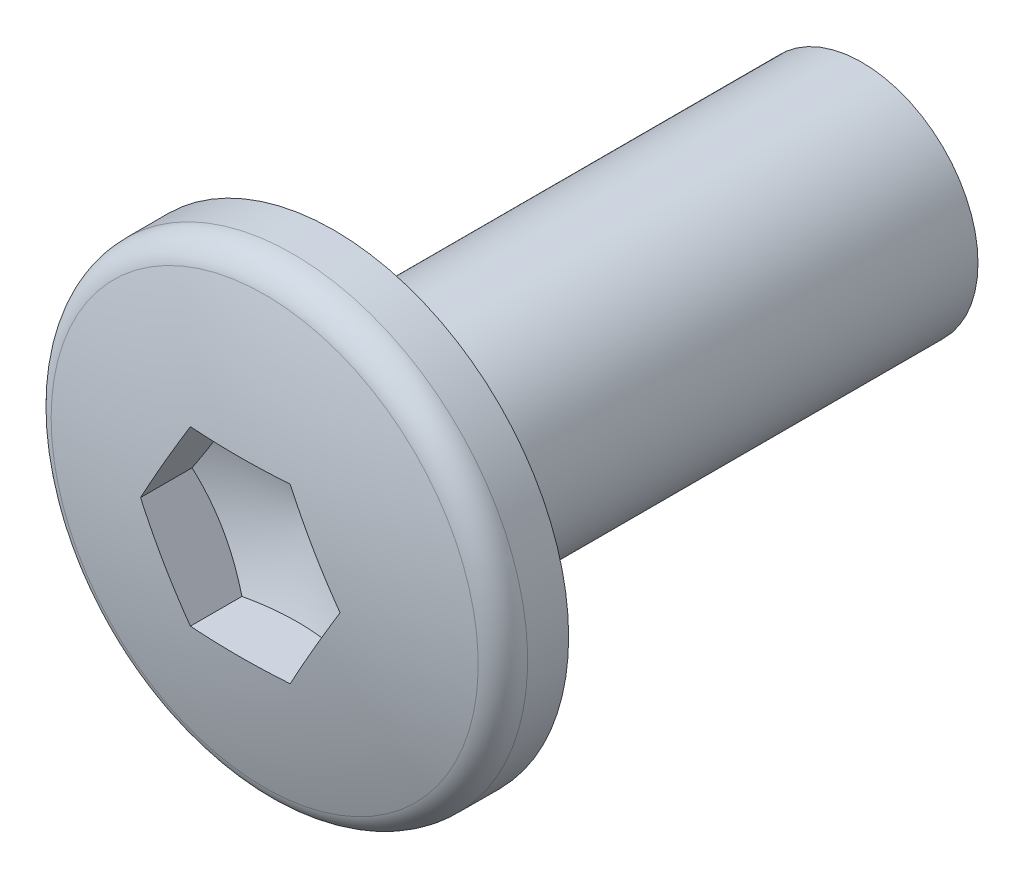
ISO-10303-21;
HEADER;
FILE_DESCRIPTION(('STEP AP214'),'2;1');
FILE_NAME('part.step','',(''),(''),'','','');
FILE_SCHEMA(('AUTOMOTIVE_DESIGN { 1 0 10303 214 1 1 1 1 }'));
ENDSEC;
DATA;
#1=APPLICATION_CONTEXT('core data for automotive mechanical design processes');
#2=APPLICATION_PROTOCOL_DEFINITION('international standard','automotive_design',2000,#1);
#3=PRODUCT_CONTEXT('',#1,'mechanical');
#4=PRODUCT('Part','Part','',(#3));
#5=PRODUCT_RELATED_PRODUCT_CATEGORY('part','',(#4));
#6=PRODUCT_DEFINITION_FORMATION('','',#4);
#7=PRODUCT_DEFINITION_CONTEXT('part definition',#1,'design');
#8=PRODUCT_DEFINITION('design','',#6,#7);
#9=PRODUCT_DEFINITION_SHAPE('','',#8);
#10=(LENGTH_UNIT() NAMED_UNIT(*) SI_UNIT(.MILLI.,.METRE.));
#11=(NAMED_UNIT(*) PLANE_ANGLE_UNIT() SI_UNIT($,.RADIAN.));
#12=(NAMED_UNIT(*) SI_UNIT($,.STERADIAN.) SOLID_ANGLE_UNIT());
#13=UNCERTAINTY_MEASURE_WITH_UNIT(LENGTH_MEASURE(1.E-05),#10,'distance_accuracy_value','');
#14=(GEOMETRIC_REPRESENTATION_CONTEXT(3) GLOBAL_UNCERTAINTY_ASSIGNED_CONTEXT((#13)) GLOBAL_UNIT_ASSIGNED_CONTEXT((#10,
#11,#12)) REPRESENTATION_CONTEXT('',''));
#15=CARTESIAN_POINT('',(0.,0.,0.));
#16=DIRECTION('',(0.,0.,1.));
#17=DIRECTION('',(1.,0.,0.));
#18=AXIS2_PLACEMENT_3D('',#15,#16,#17);
#19=CARTESIAN_POINT('',(0.,0.,-6.89219828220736));
#20=DIRECTION('',(0.,0.,-1.));
#21=DIRECTION('',(-1.,0.,0.));
#22=AXIS2_PLACEMENT_3D('',#19,#20,#21);
#23=DEGENERATE_TOROIDAL_SURFACE('',#22,0.583101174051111,28.3619515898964,.F.);
#24=CARTESIAN_POINT('',(0.,0.,20.3587998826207));
#25=DIRECTION('',(0.,0.,-1.));
#26=DIRECTION('',(-1.,0.,0.));
#27=AXIS2_PLACEMENT_3D('',#24,#25,#26);
#28=CIRCLE('',#27,7.27714036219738);
#29=CARTESIAN_POINT('',(-7.27714036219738,0.,20.3587998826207));
#30=VERTEX_POINT('',#29);
#31=EDGE_CURVE('E24',#30,#30,#28,.F.);
#32=ORIENTED_EDGE('',*,*,#31,.T.);
#33=EDGE_LOOP('',(#32));
#34=FACE_BOUND('',#33,.T.);
#35=CARTESIAN_POINT('',(3.40011547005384,0.0002,21.1886543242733));
#36=CARTESIAN_POINT('',(3.25857894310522,-0.244948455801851,21.2087713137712));
#37=CARTESIAN_POINT('',(3.11686227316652,-0.490408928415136,21.2239948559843));
#38=CARTESIAN_POINT('',(2.83343024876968,-0.981327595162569,21.24436379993));
#39=CARTESIAN_POINT('',(2.69171512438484,-1.22678539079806,21.2495220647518));
#40=CARTESIAN_POINT('',(2.40828487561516,-1.71770098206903,21.2495220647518));
#41=CARTESIAN_POINT('',(2.26656975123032,-1.96315877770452,21.24436379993));
#42=CARTESIAN_POINT('',(1.98313772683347,-2.45407744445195,21.2239948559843));
#43=CARTESIAN_POINT('',(1.84142105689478,-2.69953791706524,21.2087713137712));
#44=CARTESIAN_POINT('',(1.69988452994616,-2.94468637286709,21.1886543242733));
#45=B_SPLINE_CURVE_WITH_KNOTS('',3,(#35,#36,#37,#38,#39,#40,#41,#42,#43,#44),.UNSPECIFIED.,.F.,
.F.,(4,2,2,2,4),(0.,0.851338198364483,1.70158770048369,2.55183720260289,3.40317540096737),.UNSPECIFIED.);
#46=CARTESIAN_POINT('',(3.4,0.,21.1886707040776));
#47=VERTEX_POINT('',#46);
#48=CARTESIAN_POINT('',(1.7,-2.94448637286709,21.1886707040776));
#49=VERTEX_POINT('',#48);
#50=EDGE_CURVE('E80',#47,#49,#45,.T.);
#51=ORIENTED_EDGE('',*,*,#50,.T.);
#52=CARTESIAN_POINT('',(0.,-2.94448637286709,21.2495220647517));
#53=CARTESIAN_POINT('',(-0.246824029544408,-2.94448637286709,21.2495220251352));
#54=CARTESIAN_POINT('',(-0.493648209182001,-2.94448637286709,21.2456215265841));
#55=CARTESIAN_POINT('',(-0.98703526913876,-2.94448637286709,21.2301432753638));
#56=CARTESIAN_POINT('',(-1.23359816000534,-2.94448637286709,21.2185658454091));
#57=CARTESIAN_POINT('',(-1.9730965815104,-2.94448637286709,21.1727305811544));
#58=CARTESIAN_POINT('',(-2.46538541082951,-2.9444863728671,21.127370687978));
#59=CARTESIAN_POINT('',(-3.33984993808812,-2.94448637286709,21.0219935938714));
#60=CARTESIAN_POINT('',(-3.72268904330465,-2.94448637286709,20.9673094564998));
#61=CARTESIAN_POINT('',(-4.48569432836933,-2.94448637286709,20.8416463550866));
#62=CARTESIAN_POINT('',(-4.86586033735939,-2.94448637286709,20.7706663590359));
#63=CARTESIAN_POINT('',(-6.00175463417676,-2.94448637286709,20.5337662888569));
#64=CARTESIAN_POINT('',(-6.7526300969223,-2.94448637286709,20.3439165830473));
#65=CARTESIAN_POINT('',(-8.23728339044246,-2.94448637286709,19.9022320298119));
#66=CARTESIAN_POINT('',(-8.97102771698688,-2.94448637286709,19.6502853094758));
#67=CARTESIAN_POINT('',(-10.415049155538,-2.94448637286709,19.0865976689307));
#68=CARTESIAN_POINT('',(-11.1253305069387,-2.94448637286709,18.7748676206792));
#69=CARTESIAN_POINT('',(-12.5167269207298,-2.94448637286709,18.0943290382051));
#70=CARTESIAN_POINT('',(-13.1978823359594,-2.94448637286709,17.7256029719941));
#71=CARTESIAN_POINT('',(-14.5275431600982,-2.94448637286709,16.9332909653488));
#72=CARTESIAN_POINT('',(-15.1760471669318,-2.94448637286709,16.5097026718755));
#73=CARTESIAN_POINT('',(-16.435604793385,-2.94448637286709,15.6108566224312));
#74=CARTESIAN_POINT('',(-17.0466809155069,-2.94448637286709,15.135630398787));
#75=CARTESIAN_POINT('',(-18.2276814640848,-2.94448637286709,14.1365377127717));
#76=CARTESIAN_POINT('',(-18.7976057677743,-2.94448637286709,13.6126711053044));
#77=CARTESIAN_POINT('',(-19.9054667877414,-2.94448637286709,12.5068600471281));
#78=CARTESIAN_POINT('',(-20.4423221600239,-2.94448637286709,11.9238316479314));
#79=CARTESIAN_POINT('',(-21.465069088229,-2.94448637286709,10.7146542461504));
#80=CARTESIAN_POINT('',(-21.9509596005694,-2.9444863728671,10.0885043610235));
#81=CARTESIAN_POINT('',(-22.8684278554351,-2.9444863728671,8.79739458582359));
#82=CARTESIAN_POINT('',(-23.2999936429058,-2.94448637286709,8.13242620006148));
#83=CARTESIAN_POINT('',(-24.1056255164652,-2.9444863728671,6.76853008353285));
#84=CARTESIAN_POINT('',(-24.4796918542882,-2.9444863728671,6.06960250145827));
#85=CARTESIAN_POINT('',(-25.1679727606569,-2.9444863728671,4.64213009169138));
#86=CARTESIAN_POINT('',(-25.4821354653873,-2.9444863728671,3.91356025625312));
#87=CARTESIAN_POINT('',(-26.0479779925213,-2.9444863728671,2.43254687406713));
#88=CARTESIAN_POINT('',(-26.2996577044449,-2.9444863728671,1.68010328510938));
#89=CARTESIAN_POINT('',(-26.738737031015,-2.9444863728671,0.156724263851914));
#90=CARTESIAN_POINT('',(-26.9261394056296,-2.9444863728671,-0.614210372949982));
#91=CARTESIAN_POINT('',(-27.235348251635,-2.9444863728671,-2.16912366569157));
#92=CARTESIAN_POINT('',(-27.3571547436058,-2.9444863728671,-2.95310231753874));
#93=CARTESIAN_POINT('',(-27.5343263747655,-2.9444863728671,-4.52870533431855));
#94=CARTESIAN_POINT('',(-27.5896769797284,-2.9444863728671,-5.32033133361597));
#95=CARTESIAN_POINT('',(-27.6334951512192,-2.9444863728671,-6.90543239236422));
#96=CARTESIAN_POINT('',(-27.6219627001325,-2.9444863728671,-7.69890745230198));
#97=CARTESIAN_POINT('',(-27.5320971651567,-2.9444863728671,-9.2820567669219));
#98=CARTESIAN_POINT('',(-27.4537648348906,-2.9444863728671,-10.0717310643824));
#99=CARTESIAN_POINT('',(-27.2308570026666,-2.9444863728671,-11.6416740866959));
#100=CARTESIAN_POINT('',(-27.0862815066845,-2.9444863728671,-12.4219428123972));
#101=CARTESIAN_POINT('',(-26.7319140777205,-2.9444863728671,-13.96752895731));
#102=CARTESIAN_POINT('',(-26.5221220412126,-2.9444863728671,-14.7328463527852));
#103=CARTESIAN_POINT('',(-26.0388118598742,-2.9444863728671,-16.243087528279));
#104=CARTESIAN_POINT('',(-25.7652937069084,-2.9444863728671,-16.988011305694));
#105=CARTESIAN_POINT('',(-25.1564508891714,-2.9444863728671,-18.4522245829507));
#106=CARTESIAN_POINT('',(-24.8211214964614,-2.94448637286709,-19.1715121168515));
#107=CARTESIAN_POINT('',(-24.0910524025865,-2.9444863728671,-20.5792767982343));
#108=CARTESIAN_POINT('',(-23.6963127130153,-2.9444863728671,-21.2677539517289));
#109=CARTESIAN_POINT('',(-22.8502134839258,-2.9444863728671,-22.6090217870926));
#110=CARTESIAN_POINT('',(-22.3988521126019,-2.9444863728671,-23.2618113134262));
#111=CARTESIAN_POINT('',(-21.4427252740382,-2.94448637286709,-24.5270346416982));
#112=CARTESIAN_POINT('',(-20.9379597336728,-2.94448637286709,-25.1394683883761));
#113=CARTESIAN_POINT('',(-19.8787474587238,-2.94448637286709,-26.3194651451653));
#114=CARTESIAN_POINT('',(-19.3243135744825,-2.94448637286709,-26.887039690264));
#115=CARTESIAN_POINT('',(-18.1695927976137,-2.94448637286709,-27.9734457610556));
#116=CARTESIAN_POINT('',(-17.5693062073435,-2.94448637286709,-28.4922776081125));
#117=CARTESIAN_POINT('',(-16.3274675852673,-2.94448637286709,-29.4772365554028));
#118=CARTESIAN_POINT('',(-15.6859376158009,-2.94448637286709,-29.9433914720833));
#119=CARTESIAN_POINT('',(-14.3658545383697,-2.94448637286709,-30.8199885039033));
#120=CARTESIAN_POINT('',(-13.687300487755,-2.94448637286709,-31.2304291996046));
#121=CARTESIAN_POINT('',(-12.2974264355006,-2.94448637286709,-31.9929324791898));
#122=CARTESIAN_POINT('',(-11.5860799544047,-2.94448637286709,-32.3449467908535));
#123=CARTESIAN_POINT('',(-10.1362245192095,-2.94448637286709,-32.9875689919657));
#124=CARTESIAN_POINT('',(-9.39771817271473,-2.9444863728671,-33.2781827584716));
#125=CARTESIAN_POINT('',(-7.94736216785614,-2.94448637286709,-33.7789845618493));
#126=CARTESIAN_POINT('',(-7.2368854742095,-2.94448637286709,-33.9931634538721));
#127=CARTESIAN_POINT('',(-5.80086511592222,-2.94448637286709,-34.3642185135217));
#128=CARTESIAN_POINT('',(-5.07531898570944,-2.94448637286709,-34.5210852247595));
#129=CARTESIAN_POINT('',(-3.98002928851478,-2.94448637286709,-34.7115778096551));
#130=CARTESIAN_POINT('',(-3.6140525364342,-2.94448637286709,-34.7675817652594));
#131=CARTESIAN_POINT('',(-2.88004960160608,-2.94448637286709,-34.8642903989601));
#132=CARTESIAN_POINT('',(-2.51202339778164,-2.94448637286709,-34.9049949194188));
#133=CARTESIAN_POINT('',(-1.77469240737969,-2.94448637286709,-34.9703644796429));
#134=CARTESIAN_POINT('',(-1.40538819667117,-2.94448637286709,-34.9950359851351));
#135=CARTESIAN_POINT('',(-0.666041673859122,-2.94448637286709,-35.0273364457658));
#136=CARTESIAN_POINT('',(-0.295999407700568,-2.94448637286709,-35.0349664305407));
#137=CARTESIAN_POINT('',(0.444678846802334,-2.94448637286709,-35.0326355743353));
#138=CARTESIAN_POINT('',(0.815314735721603,-2.94448637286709,-35.0226437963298));
#139=CARTESIAN_POINT('',(1.55574736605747,-2.94448637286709,-34.9856999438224));
#140=CARTESIAN_POINT('',(1.92554405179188,-2.94448637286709,-34.9587467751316));
#141=CARTESIAN_POINT('',(2.66377897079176,-2.94448637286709,-34.8888768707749));
#142=CARTESIAN_POINT('',(3.03221656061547,-2.94448637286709,-34.8459533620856));
#143=CARTESIAN_POINT('',(3.76695374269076,-2.94448637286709,-34.7448284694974));
#144=CARTESIAN_POINT('',(4.13325336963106,-2.94448637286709,-34.6866273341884));
#145=CARTESIAN_POINT('',(5.22929620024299,-2.94448637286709,-34.4895439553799));
#146=CARTESIAN_POINT('',(5.95514013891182,-2.94448637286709,-34.3282828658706));
#147=CARTESIAN_POINT('',(7.39136185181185,-2.94448637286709,-33.9483790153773));
#148=CARTESIAN_POINT('',(8.10174295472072,-2.94448637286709,-33.7297487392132));
#149=CARTESIAN_POINT('',(9.50526747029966,-2.94448637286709,-33.2359558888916));
#150=CARTESIAN_POINT('',(10.1983454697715,-2.94448637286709,-32.9606071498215));
#151=CARTESIAN_POINT('',(11.5604600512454,-2.94448637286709,-32.3557146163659));
#152=CARTESIAN_POINT('',(12.2294955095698,-2.94448637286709,-32.0261682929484));
#153=CARTESIAN_POINT('',(13.5387601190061,-2.94448637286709,-31.3153328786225));
#154=CARTESIAN_POINT('',(14.1790131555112,-2.94448637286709,-30.9340877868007));
#155=CARTESIAN_POINT('',(15.4273114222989,-2.94448637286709,-30.1220759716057));
#156=CARTESIAN_POINT('',(16.0353559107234,-2.94448637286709,-29.6913081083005));
#157=CARTESIAN_POINT('',(17.2519657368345,-2.94448637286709,-28.754843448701));
#158=CARTESIAN_POINT('',(17.8582351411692,-2.94448637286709,-28.2461595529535));
#159=CARTESIAN_POINT('',(19.0258877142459,-2.94448637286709,-27.179614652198));
#160=CARTESIAN_POINT('',(19.5872687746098,-2.94448637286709,-26.621751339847));
#161=CARTESIAN_POINT('',(20.6614038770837,-2.94448637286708,-25.4605536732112));
#162=CARTESIAN_POINT('',(21.1741359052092,-2.94448637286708,-24.857198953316));
#163=CARTESIAN_POINT('',(22.1470528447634,-2.94448637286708,-23.6095262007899));
#164=CARTESIAN_POINT('',(22.6072382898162,-2.94448637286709,-22.9652085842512));
#165=CARTESIAN_POINT('',(23.4726407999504,-2.94448637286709,-21.6389032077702));
#166=CARTESIAN_POINT('',(23.8777513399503,-2.94448637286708,-20.9568459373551));
#167=CARTESIAN_POINT('',(24.6290908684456,-2.94448637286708,-19.5610335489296));
#168=CARTESIAN_POINT('',(24.9753196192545,-2.94448637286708,-18.8472783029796));
#169=CARTESIAN_POINT('',(25.60640029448,-2.94448637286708,-17.3932276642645));
#170=CARTESIAN_POINT('',(25.8912592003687,-2.94448637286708,-16.6529353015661));
#171=CARTESIAN_POINT('',(26.3976280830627,-2.94448637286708,-15.150993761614));
#172=CARTESIAN_POINT('',(26.6191381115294,-2.94448637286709,-14.3893446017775));
#173=CARTESIAN_POINT('',(26.9973099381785,-2.94448637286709,-12.8498039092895));
#174=CARTESIAN_POINT('',(27.1539468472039,-2.94448637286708,-12.0719062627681));
#175=CARTESIAN_POINT('',(27.4011375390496,-2.94448637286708,-10.5056810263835));
#176=CARTESIAN_POINT('',(27.4916912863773,-2.94448637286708,-9.71735343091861));
#177=CARTESIAN_POINT('',(27.6060734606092,-2.94448637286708,-8.13585677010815));
#178=CARTESIAN_POINT('',(27.6299005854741,-2.94448637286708,-7.34268761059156));
#179=CARTESIAN_POINT('',(27.6106565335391,-2.94448637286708,-5.75716134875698));
#180=CARTESIAN_POINT('',(27.5675853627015,-2.94448637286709,-4.96480424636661));
#181=CARTESIAN_POINT('',(27.4148468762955,-2.94448637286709,-3.38649513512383));
#182=CARTESIAN_POINT('',(27.3051762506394,-2.94448637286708,-2.60054344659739));
#183=CARTESIAN_POINT('',(27.0200151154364,-2.94448637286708,-1.04067254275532));
#184=CARTESIAN_POINT('',(26.8445245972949,-2.94448637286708,-0.266753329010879));
#185=CARTESIAN_POINT('',(26.4289633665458,-2.94448637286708,1.26357596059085));
#186=CARTESIAN_POINT('',(26.1888904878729,-2.94448637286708,2.019985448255));
#187=CARTESIAN_POINT('',(25.6458727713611,-2.94448637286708,3.50988969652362));
#188=CARTESIAN_POINT('',(25.34292794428,-2.94448637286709,4.24338446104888));
#189=CARTESIAN_POINT('',(24.6763029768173,-2.94448637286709,5.68227651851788));
#190=CARTESIAN_POINT('',(24.3126200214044,-2.94448637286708,6.38767250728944));
#191=CARTESIAN_POINT('',(23.5271119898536,-2.94448637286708,7.76531384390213));
#192=CARTESIAN_POINT('',(23.1052868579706,-2.94448637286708,8.43755915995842));
#193=CARTESIAN_POINT('',(22.2065669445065,-2.94448637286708,9.74400520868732));
#194=CARTESIAN_POINT('',(21.7296814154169,-2.94448637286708,10.3782123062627));
#195=CARTESIAN_POINT('',(20.7241721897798,-2.94448637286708,11.6041885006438));
#196=CARTESIAN_POINT('',(20.195548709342,-2.94448637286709,12.1959577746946));
#197=CARTESIAN_POINT('',(19.0905427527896,-2.94448637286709,13.3326125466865));
#198=CARTESIAN_POINT('',(18.5141800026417,-2.94448637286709,13.8775172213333));
#199=CARTESIAN_POINT('',(17.3175874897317,-2.94448637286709,14.9168394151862));
#200=CARTESIAN_POINT('',(16.6973570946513,-2.94448637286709,15.4112562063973));
#201=CARTESIAN_POINT('',(15.4169898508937,-2.94448637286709,16.3463857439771));
#202=CARTESIAN_POINT('',(14.7568256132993,-2.94448637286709,16.7870609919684));
#203=CARTESIAN_POINT('',(13.4017038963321,-2.94448637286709,17.6111157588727));
#204=CARTESIAN_POINT('',(12.706748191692,-2.94448637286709,17.9944981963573));
#205=CARTESIAN_POINT('',(11.2868579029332,-2.94448637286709,18.7012426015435));
#206=CARTESIAN_POINT('',(10.5619202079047,-2.94448637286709,19.0245983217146));
#207=CARTESIAN_POINT('',(9.08716421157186,-2.94448637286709,19.6088548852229));
#208=CARTESIAN_POINT('',(8.33734113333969,-2.94448637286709,19.8697436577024));
#209=CARTESIAN_POINT('',(6.81958984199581,-2.94448637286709,20.3264296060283));
#210=CARTESIAN_POINT('',(6.05169970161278,-2.94448637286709,20.5223524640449));
#211=CARTESIAN_POINT('',(4.88978942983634,-2.94448637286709,20.766143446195));
#212=CARTESIAN_POINT('',(4.50087472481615,-2.94448637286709,20.8390499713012));
#213=CARTESIAN_POINT('',(3.72024402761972,-2.94448637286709,20.9678068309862));
#214=CARTESIAN_POINT('',(3.32852823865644,-2.94448637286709,21.0236583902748));
#215=CARTESIAN_POINT('',(2.44847272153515,-2.94448637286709,21.1290177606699));
#216=CARTESIAN_POINT('',(1.95954654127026,-2.94448637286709,21.1737713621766));
#217=CARTESIAN_POINT('',(1.22511622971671,-2.94448637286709,21.2189882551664));
#218=CARTESIAN_POINT('',(0.980246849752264,-2.94448637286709,21.2304080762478));
#219=CARTESIAN_POINT('',(0.490251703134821,-2.94448637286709,21.2456751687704));
#220=CARTESIAN_POINT('',(0.245125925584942,-2.94448637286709,21.2495221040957));
#221=CARTESIAN_POINT('',(0.,-2.94448637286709,21.2495220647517));
#222=B_SPLINE_CURVE_WITH_KNOTS('',3,(#52,#53,#54,#55,#56,#57,#58,#59,#60,#61,#62,#63,#64,#65,
#66,#67,#68,#69,#70,#71,#72,#73,#74,#75,#76,#77,#78,#79,#80,#81,#82,#83,#84,#85,#86,#87,#88,#89,
#90,#91,#92,#93,#94,#95,#96,#97,#98,#99,#100,#101,#102,#103,#104,#105,#106,#107,#108,#109,#110,
#111,#112,#113,#114,#115,#116,#117,#118,#119,#120,#121,#122,#123,#124,#125,#126,#127,#128,#129,
#130,#131,#132,#133,#134,#135,#136,#137,#138,#139,#140,#141,#142,#143,#144,#145,#146,#147,#148,
#149,#150,#151,#152,#153,#154,#155,#156,#157,#158,#159,#160,#161,#162,#163,#164,#165,#166,#167,
#168,#169,#170,#171,#172,#173,#174,#175,#176,#177,#178,#179,#180,#181,#182,#183,#184,#185,#186,
#187,#188,#189,#190,#191,#192,#193,#194,#195,#196,#197,#198,#199,#200,#201,#202,#203,#204,#205,
#206,#207,#208,#209,#210,#211,#212,#213,#214,#215,#216,#217,#218,#219,#220,#221),.UNSPECIFIED.,
.T.,.F.,(4,2,2,2,2,2,2,2,2,2,2,2,2,2,2,2,2,2,2,2,2,2,2,2,2,2,2,2,2,2,2,2,2,2,2,2,2,2,2,2,2,2,2,
2,2,2,2,2,2,2,2,2,2,2,2,2,2,2,2,2,2,2,2,2,2,2,2,2,2,2,2,2,2,2,2,2,2,2,2,2,2,2,2,2,4),(0.,
0.740438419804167,1.4808457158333,2.96302740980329,4.12286507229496,5.28277620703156,
7.60334890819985,9.92813327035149,12.2524952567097,14.5735250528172,16.8946544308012,
19.2143743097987,21.5341011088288,23.9089279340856,26.2838033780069,28.6592005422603,
31.0345873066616,33.4120214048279,35.7894597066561,38.1667959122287,40.544131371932,
42.9219866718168,45.2998425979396,47.6776716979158,50.05550058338,52.4333332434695,
54.8111662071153,57.1891811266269,59.5671955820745,61.9452869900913,64.32338165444,
66.7008628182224,69.0783283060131,71.4545324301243,73.8307970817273,76.2090153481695,
78.5870058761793,80.8109267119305,83.0352143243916,84.1456668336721,85.2561307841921,
86.3661466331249,87.4760954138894,88.5879947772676,89.6999658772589,90.8124091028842,
91.9248342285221,94.1528193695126,96.38032005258,98.6152519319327,100.850288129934,
103.083433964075,105.316631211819,107.688015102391,110.059510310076,112.432073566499,
114.804612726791,117.181677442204,119.558751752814,121.935555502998,124.312357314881,
126.690070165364,129.067784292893,131.445544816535,133.823305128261,136.201183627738,
138.579062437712,140.957021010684,143.334979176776,145.713047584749,148.091118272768,
150.468789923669,152.846451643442,155.223135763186,157.599854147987,159.978221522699,
162.3564676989,164.734961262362,167.113914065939,169.488237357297,170.674990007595,
171.861657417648,173.333649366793,174.068961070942,174.804305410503),.UNSPECIFIED.);
#223=CARTESIAN_POINT('',(-1.7,-2.94448637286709,21.1886707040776));
#224=VERTEX_POINT('',#223);
#225=EDGE_CURVE('E39',#49,#224,#222,.T.);
#226=ORIENTED_EDGE('',*,*,#225,.T.);
#227=CARTESIAN_POINT('',(-1.69988452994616,-2.94468637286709,21.1886543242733));
#228=CARTESIAN_POINT('',(-1.84142105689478,-2.69953791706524,21.2087713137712));
#229=CARTESIAN_POINT('',(-1.98313772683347,-2.45407744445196,21.2239948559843));
#230=CARTESIAN_POINT('',(-2.26656975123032,-1.96315877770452,21.24436379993));
#231=CARTESIAN_POINT('',(-2.40828487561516,-1.71770098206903,21.2495220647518));
#232=CARTESIAN_POINT('',(-2.69171512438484,-1.22678539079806,21.2495220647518));
#233=CARTESIAN_POINT('',(-2.83343024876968,-0.98132759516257,21.24436379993));
#234=CARTESIAN_POINT('',(-3.11686227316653,-0.490408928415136,21.2239948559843));
#235=CARTESIAN_POINT('',(-3.25857894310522,-0.24494845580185,21.2087713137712));
#236=CARTESIAN_POINT('',(-3.40011547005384,0.000200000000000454,21.1886543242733));
#237=B_SPLINE_CURVE_WITH_KNOTS('',3,(#227,#228,#229,#230,#231,#232,#233,#234,#235,#236),
.UNSPECIFIED.,.F.,.F.,(4,2,2,2,4),(0.,0.851338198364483,1.70158770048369,2.55183720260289,
3.40317540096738),.UNSPECIFIED.);
#238=CARTESIAN_POINT('',(-3.4,0.,21.1886707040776));
#239=VERTEX_POINT('',#238);
#240=EDGE_CURVE('E180',#224,#239,#237,.T.);
#241=ORIENTED_EDGE('',*,*,#240,.T.);
#242=CARTESIAN_POINT('',(-3.40011547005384,-0.000199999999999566,21.1886543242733));
#243=CARTESIAN_POINT('',(-3.25857894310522,0.244948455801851,21.2087713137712));
#244=CARTESIAN_POINT('',(-3.11686227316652,0.490408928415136,21.2239948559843));
#245=CARTESIAN_POINT('',(-2.83343024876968,0.98132759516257,21.24436379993));
#246=CARTESIAN_POINT('',(-2.69171512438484,1.22678539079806,21.2495220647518));
#247=CARTESIAN_POINT('',(-2.40828487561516,1.71770098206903,21.2495220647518));
#248=CARTESIAN_POINT('',(-2.26656975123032,1.96315877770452,21.24436379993));
#249=CARTESIAN_POINT('',(-1.98313772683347,2.45407744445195,21.2239948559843));
#250=CARTESIAN_POINT('',(-1.84142105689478,2.69953791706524,21.2087713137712));
#251=CARTESIAN_POINT('',(-1.69988452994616,2.94468637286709,21.1886543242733));
#252=B_SPLINE_CURVE_WITH_KNOTS('',3,(#242,#243,#244,#245,#246,#247,#248,#249,#250,#251),
.UNSPECIFIED.,.F.,.F.,(4,2,2,2,4),(0.,0.851338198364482,1.70158770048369,2.55183720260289,
3.40317540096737),.UNSPECIFIED.);
#253=CARTESIAN_POINT('',(-1.7,2.94448637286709,21.1886707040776));
#254=VERTEX_POINT('',#253);
#255=EDGE_CURVE('E189',#239,#254,#252,.T.);
#256=ORIENTED_EDGE('',*,*,#255,.T.);
#257=CARTESIAN_POINT('',(0.,2.94448637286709,21.2495220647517));
#258=CARTESIAN_POINT('',(0.246824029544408,2.94448637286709,21.2495220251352));
#259=CARTESIAN_POINT('',(0.493648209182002,2.94448637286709,21.2456215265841));
#260=CARTESIAN_POINT('',(0.98703526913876,2.94448637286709,21.2301432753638));
#261=CARTESIAN_POINT('',(1.23359816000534,2.94448637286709,21.2185658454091));
#262=CARTESIAN_POINT('',(1.9730965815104,2.94448637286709,21.1727305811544));
#263=CARTESIAN_POINT('',(2.46538541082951,2.94448637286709,21.127370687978));
#264=CARTESIAN_POINT('',(3.33984993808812,2.94448637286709,21.0219935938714));
#265=CARTESIAN_POINT('',(3.72268904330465,2.94448637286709,20.9673094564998));
#266=CARTESIAN_POINT('',(4.48569432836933,2.94448637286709,20.8416463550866));
#267=CARTESIAN_POINT('',(4.86586033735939,2.94448637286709,20.7706663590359));
#268=CARTESIAN_POINT('',(6.00175463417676,2.94448637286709,20.5337662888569));
#269=CARTESIAN_POINT('',(6.7526300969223,2.94448637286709,20.3439165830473));
#270=CARTESIAN_POINT('',(8.23728339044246,2.94448637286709,19.9022320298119));
#271=CARTESIAN_POINT('',(8.97102771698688,2.94448637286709,19.6502853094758));
#272=CARTESIAN_POINT('',(10.415049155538,2.94448637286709,19.0865976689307));
#273=CARTESIAN_POINT('',(11.1253305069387,2.94448637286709,18.7748676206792));
#274=CARTESIAN_POINT('',(12.5167269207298,2.94448637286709,18.0943290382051));
#275=CARTESIAN_POINT('',(13.1978823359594,2.94448637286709,17.7256029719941));
#276=CARTESIAN_POINT('',(14.5275431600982,2.94448637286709,16.9332909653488));
#277=CARTESIAN_POINT('',(15.1760471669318,2.94448637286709,16.5097026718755));
#278=CARTESIAN_POINT('',(16.435604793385,2.94448637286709,15.6108566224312));
#279=CARTESIAN_POINT('',(17.0466809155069,2.94448637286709,15.135630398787));
#280=CARTESIAN_POINT('',(18.2276814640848,2.94448637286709,14.1365377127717));
#281=CARTESIAN_POINT('',(18.7976057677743,2.94448637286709,13.6126711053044));
#282=CARTESIAN_POINT('',(19.9054667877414,2.94448637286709,12.5068600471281));
#283=CARTESIAN_POINT('',(20.4423221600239,2.94448637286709,11.9238316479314));
#284=CARTESIAN_POINT('',(21.465069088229,2.94448637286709,10.7146542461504));
#285=CARTESIAN_POINT('',(21.9509596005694,2.94448637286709,10.0885043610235));
#286=CARTESIAN_POINT('',(22.8684278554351,2.94448637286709,8.79739458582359));
#287=CARTESIAN_POINT('',(23.2999936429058,2.94448637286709,8.13242620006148));
#288=CARTESIAN_POINT('',(24.1056255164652,2.94448637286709,6.76853008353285));
#289=CARTESIAN_POINT('',(24.4796918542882,2.94448637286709,6.06960250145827));
#290=CARTESIAN_POINT('',(25.1679727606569,2.94448637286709,4.64213009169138));
#291=CARTESIAN_POINT('',(25.4821354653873,2.94448637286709,3.91356025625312));
#292=CARTESIAN_POINT('',(26.0479779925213,2.94448637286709,2.43254687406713));
#293=CARTESIAN_POINT('',(26.2996577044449,2.94448637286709,1.68010328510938));
#294=CARTESIAN_POINT('',(26.738737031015,2.94448637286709,0.156724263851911));
#295=CARTESIAN_POINT('',(26.9261394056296,2.94448637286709,-0.614210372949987));
#296=CARTESIAN_POINT('',(27.235348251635,2.94448637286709,-2.16912366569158));
#297=CARTESIAN_POINT('',(27.3571547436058,2.94448637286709,-2.95310231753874));
#298=CARTESIAN_POINT('',(27.5343263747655,2.94448637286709,-4.52870533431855));
#299=CARTESIAN_POINT('',(27.5896769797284,2.94448637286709,-5.32033133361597));
#300=CARTESIAN_POINT('',(27.6334951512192,2.94448637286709,-6.90543239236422));
#301=CARTESIAN_POINT('',(27.6219627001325,2.94448637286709,-7.69890745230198));
#302=CARTESIAN_POINT('',(27.5320971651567,2.94448637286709,-9.28205676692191));
#303=CARTESIAN_POINT('',(27.4537648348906,2.94448637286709,-10.0717310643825));
#304=CARTESIAN_POINT('',(27.2308570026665,2.94448637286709,-11.6416740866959));
#305=CARTESIAN_POINT('',(27.0862815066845,2.94448637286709,-12.4219428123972));
#306=CARTESIAN_POINT('',(26.7319140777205,2.94448637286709,-13.96752895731));
#307=CARTESIAN_POINT('',(26.5221220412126,2.94448637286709,-14.7328463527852));
#308=CARTESIAN_POINT('',(26.0388118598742,2.94448637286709,-16.243087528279));
#309=CARTESIAN_POINT('',(25.7652937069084,2.94448637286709,-16.988011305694));
#310=CARTESIAN_POINT('',(25.1564508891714,2.94448637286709,-18.4522245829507));
#311=CARTESIAN_POINT('',(24.8211214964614,2.94448637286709,-19.1715121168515));
#312=CARTESIAN_POINT('',(24.0910524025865,2.94448637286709,-20.5792767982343));
#313=CARTESIAN_POINT('',(23.6963127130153,2.94448637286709,-21.2677539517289));
#314=CARTESIAN_POINT('',(22.8502134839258,2.94448637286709,-22.6090217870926));
#315=CARTESIAN_POINT('',(22.3988521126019,2.94448637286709,-23.2618113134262));
#316=CARTESIAN_POINT('',(21.4427252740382,2.94448637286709,-24.5270346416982));
#317=CARTESIAN_POINT('',(20.9379597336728,2.94448637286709,-25.1394683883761));
#318=CARTESIAN_POINT('',(19.8787474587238,2.94448637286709,-26.3194651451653));
#319=CARTESIAN_POINT('',(19.3243135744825,2.94448637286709,-26.887039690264));
#320=CARTESIAN_POINT('',(18.1695927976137,2.94448637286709,-27.9734457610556));
#321=CARTESIAN_POINT('',(17.5693062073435,2.94448637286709,-28.4922776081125));
#322=CARTESIAN_POINT('',(16.3274675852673,2.94448637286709,-29.4772365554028));
#323=CARTESIAN_POINT('',(15.6859376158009,2.94448637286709,-29.9433914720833));
#324=CARTESIAN_POINT('',(14.3658545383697,2.94448637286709,-30.8199885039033));
#325=CARTESIAN_POINT('',(13.687300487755,2.94448637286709,-31.2304291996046));
#326=CARTESIAN_POINT('',(12.2974264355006,2.94448637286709,-31.9929324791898));
#327=CARTESIAN_POINT('',(11.5860799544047,2.94448637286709,-32.3449467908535));
#328=CARTESIAN_POINT('',(10.1362245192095,2.94448637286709,-32.9875689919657));
#329=CARTESIAN_POINT('',(9.39771817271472,2.94448637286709,-33.2781827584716));
#330=CARTESIAN_POINT('',(7.94736216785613,2.94448637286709,-33.7789845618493));
#331=CARTESIAN_POINT('',(7.23688547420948,2.94448637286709,-33.9931634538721));
#332=CARTESIAN_POINT('',(5.80086511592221,2.94448637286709,-34.3642185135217));
#333=CARTESIAN_POINT('',(5.07531898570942,2.94448637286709,-34.5210852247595));
#334=CARTESIAN_POINT('',(3.98002928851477,2.94448637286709,-34.7115778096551));
#335=CARTESIAN_POINT('',(3.61405253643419,2.94448637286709,-34.7675817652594));
#336=CARTESIAN_POINT('',(2.88004960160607,2.94448637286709,-34.8642903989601));
#337=CARTESIAN_POINT('',(2.51202339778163,2.94448637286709,-34.9049949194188));
#338=CARTESIAN_POINT('',(1.77469240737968,2.94448637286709,-34.9703644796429));
#339=CARTESIAN_POINT('',(1.40538819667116,2.94448637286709,-34.9950359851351));
#340=CARTESIAN_POINT('',(0.666041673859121,2.94448637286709,-35.0273364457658));
#341=CARTESIAN_POINT('',(0.295999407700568,2.94448637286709,-35.0349664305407));
#342=CARTESIAN_POINT('',(-0.444678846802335,2.94448637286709,-35.0326355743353));
#343=CARTESIAN_POINT('',(-0.815314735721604,2.94448637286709,-35.0226437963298));
#344=CARTESIAN_POINT('',(-1.55574736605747,2.94448637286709,-34.9856999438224));
#345=CARTESIAN_POINT('',(-1.92554405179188,2.94448637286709,-34.9587467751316));
#346=CARTESIAN_POINT('',(-2.66377897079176,2.94448637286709,-34.8888768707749));
#347=CARTESIAN_POINT('',(-3.03221656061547,2.94448637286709,-34.8459533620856));
#348=CARTESIAN_POINT('',(-3.76695374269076,2.94448637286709,-34.7448284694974));
#349=CARTESIAN_POINT('',(-4.13325336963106,2.94448637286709,-34.6866273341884));
#350=CARTESIAN_POINT('',(-5.229296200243,2.94448637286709,-34.4895439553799));
#351=CARTESIAN_POINT('',(-5.95514013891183,2.94448637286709,-34.3282828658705));
#352=CARTESIAN_POINT('',(-7.39136185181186,2.94448637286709,-33.9483790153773));
#353=CARTESIAN_POINT('',(-8.10174295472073,2.94448637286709,-33.7297487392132));
#354=CARTESIAN_POINT('',(-9.50526747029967,2.94448637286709,-33.2359558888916));
#355=CARTESIAN_POINT('',(-10.1983454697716,2.94448637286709,-32.9606071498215));
#356=CARTESIAN_POINT('',(-11.5604600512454,2.94448637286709,-32.3557146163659));
#357=CARTESIAN_POINT('',(-12.2294955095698,2.94448637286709,-32.0261682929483));
#358=CARTESIAN_POINT('',(-13.5387601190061,2.94448637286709,-31.3153328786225));
#359=CARTESIAN_POINT('',(-14.1790131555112,2.94448637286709,-30.9340877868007));
#360=CARTESIAN_POINT('',(-15.4273114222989,2.94448637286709,-30.1220759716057));
#361=CARTESIAN_POINT('',(-16.0353559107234,2.94448637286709,-29.6913081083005));
#362=CARTESIAN_POINT('',(-17.2519657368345,2.94448637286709,-28.754843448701));
#363=CARTESIAN_POINT('',(-17.8582351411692,2.94448637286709,-28.2461595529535));
#364=CARTESIAN_POINT('',(-19.0258877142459,2.94448637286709,-27.179614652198));
#365=CARTESIAN_POINT('',(-19.5872687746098,2.94448637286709,-26.621751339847));
#366=CARTESIAN_POINT('',(-20.6614038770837,2.94448637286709,-25.4605536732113));
#367=CARTESIAN_POINT('',(-21.1741359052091,2.94448637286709,-24.857198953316));
#368=CARTESIAN_POINT('',(-22.1470528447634,2.94448637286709,-23.6095262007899));
#369=CARTESIAN_POINT('',(-22.6072382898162,2.94448637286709,-22.9652085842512));
#370=CARTESIAN_POINT('',(-23.4726407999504,2.94448637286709,-21.6389032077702));
#371=CARTESIAN_POINT('',(-23.8777513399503,2.94448637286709,-20.9568459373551));
#372=CARTESIAN_POINT('',(-24.6290908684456,2.94448637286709,-19.5610335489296));
#373=CARTESIAN_POINT('',(-24.9753196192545,2.94448637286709,-18.8472783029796));
#374=CARTESIAN_POINT('',(-25.60640029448,2.94448637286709,-17.3932276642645));
#375=CARTESIAN_POINT('',(-25.8912592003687,2.94448637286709,-16.6529353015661));
#376=CARTESIAN_POINT('',(-26.3976280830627,2.94448637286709,-15.150993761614));
#377=CARTESIAN_POINT('',(-26.6191381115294,2.94448637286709,-14.3893446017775));
#378=CARTESIAN_POINT('',(-26.9973099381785,2.94448637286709,-12.8498039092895));
#379=CARTESIAN_POINT('',(-27.1539468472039,2.94448637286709,-12.0719062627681));
#380=CARTESIAN_POINT('',(-27.4011375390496,2.94448637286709,-10.5056810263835));
#381=CARTESIAN_POINT('',(-27.4916912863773,2.94448637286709,-9.7173534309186));
#382=CARTESIAN_POINT('',(-27.6060734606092,2.94448637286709,-8.13585677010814));
#383=CARTESIAN_POINT('',(-27.6299005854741,2.94448637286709,-7.34268761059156));
#384=CARTESIAN_POINT('',(-27.6106565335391,2.94448637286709,-5.75716134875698));
#385=CARTESIAN_POINT('',(-27.5675853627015,2.94448637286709,-4.96480424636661));
#386=CARTESIAN_POINT('',(-27.4148468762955,2.94448637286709,-3.38649513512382));
#387=CARTESIAN_POINT('',(-27.3051762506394,2.94448637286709,-2.60054344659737));
#388=CARTESIAN_POINT('',(-27.0200151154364,2.94448637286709,-1.0406725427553));
#389=CARTESIAN_POINT('',(-26.8445245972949,2.94448637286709,-0.266753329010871));
#390=CARTESIAN_POINT('',(-26.4289633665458,2.94448637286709,1.26357596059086));
#391=CARTESIAN_POINT('',(-26.1888904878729,2.94448637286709,2.01998544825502));
#392=CARTESIAN_POINT('',(-25.6458727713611,2.94448637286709,3.50988969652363));
#393=CARTESIAN_POINT('',(-25.34292794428,2.94448637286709,4.24338446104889));
#394=CARTESIAN_POINT('',(-24.6763029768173,2.94448637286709,5.68227651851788));
#395=CARTESIAN_POINT('',(-24.3126200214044,2.94448637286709,6.38767250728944));
#396=CARTESIAN_POINT('',(-23.5271119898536,2.94448637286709,7.76531384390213));
#397=CARTESIAN_POINT('',(-23.1052868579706,2.94448637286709,8.43755915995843));
#398=CARTESIAN_POINT('',(-22.2065669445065,2.94448637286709,9.74400520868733));
#399=CARTESIAN_POINT('',(-21.7296814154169,2.94448637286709,10.3782123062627));
#400=CARTESIAN_POINT('',(-20.7241721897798,2.94448637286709,11.6041885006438));
#401=CARTESIAN_POINT('',(-20.195548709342,2.94448637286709,12.1959577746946));
#402=CARTESIAN_POINT('',(-19.0905427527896,2.94448637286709,13.3326125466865));
#403=CARTESIAN_POINT('',(-18.5141800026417,2.94448637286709,13.8775172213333));
#404=CARTESIAN_POINT('',(-17.3175874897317,2.94448637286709,14.9168394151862));
#405=CARTESIAN_POINT('',(-16.6973570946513,2.94448637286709,15.4112562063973));
#406=CARTESIAN_POINT('',(-15.4169898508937,2.94448637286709,16.3463857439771));
#407=CARTESIAN_POINT('',(-14.7568256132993,2.94448637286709,16.7870609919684));
#408=CARTESIAN_POINT('',(-13.4017038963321,2.94448637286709,17.6111157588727));
#409=CARTESIAN_POINT('',(-12.706748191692,2.94448637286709,17.9944981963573));
#410=CARTESIAN_POINT('',(-11.2868579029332,2.94448637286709,18.7012426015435));
#411=CARTESIAN_POINT('',(-10.5619202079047,2.94448637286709,19.0245983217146));
#412=CARTESIAN_POINT('',(-9.08716421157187,2.94448637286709,19.6088548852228));
#413=CARTESIAN_POINT('',(-8.33734113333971,2.94448637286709,19.8697436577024));
#414=CARTESIAN_POINT('',(-6.81958984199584,2.94448637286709,20.3264296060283));
#415=CARTESIAN_POINT('',(-6.0516997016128,2.94448637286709,20.5223524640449));
#416=CARTESIAN_POINT('',(-4.88978942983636,2.94448637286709,20.766143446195));
#417=CARTESIAN_POINT('',(-4.50087472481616,2.94448637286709,20.8390499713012));
#418=CARTESIAN_POINT('',(-3.72024402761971,2.94448637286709,20.9678068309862));
#419=CARTESIAN_POINT('',(-3.32852823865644,2.94448637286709,21.0236583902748));
#420=CARTESIAN_POINT('',(-2.44847272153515,2.94448637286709,21.1290177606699));
#421=CARTESIAN_POINT('',(-1.95954654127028,2.94448637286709,21.1737713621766));
#422=CARTESIAN_POINT('',(-1.22511622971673,2.94448637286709,21.2189882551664));
#423=CARTESIAN_POINT('',(-0.980246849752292,2.94448637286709,21.2304080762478));
#424=CARTESIAN_POINT('',(-0.490251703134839,2.94448637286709,21.2456751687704));
#425=CARTESIAN_POINT('',(-0.245125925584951,2.94448637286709,21.2495221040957));
#426=CARTESIAN_POINT('',(0.,2.94448637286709,21.2495220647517));
#427=B_SPLINE_CURVE_WITH_KNOTS('',3,(#257,#258,#259,#260,#261,#262,#263,#264,#265,#266,#267,
#268,#269,#270,#271,#272,#273,#274,#275,#276,#277,#278,#279,#280,#281,#282,#283,#284,#285,#286,
#287,#288,#289,#290,#291,#292,#293,#294,#295,#296,#297,#298,#299,#300,#301,#302,#303,#304,#305,
#306,#307,#308,#309,#310,#311,#312,#313,#314,#315,#316,#317,#318,#319,#320,#321,#322,#323,#324,
#325,#326,#327,#328,#329,#330,#331,#332,#333,#334,#335,#336,#337,#338,#339,#340,#341,#342,#343,
#344,#345,#346,#347,#348,#349,#350,#351,#352,#353,#354,#355,#356,#357,#358,#359,#360,#361,#362,
#363,#364,#365,#366,#367,#368,#369,#370,#371,#372,#373,#374,#375,#376,#377,#378,#379,#380,#381,
#382,#383,#384,#385,#386,#387,#388,#389,#390,#391,#392,#393,#394,#395,#396,#397,#398,#399,#400,
#401,#402,#403,#404,#405,#406,#407,#408,#409,#410,#411,#412,#413,#414,#415,#416,#417,#418,#419,
#420,#421,#422,#423,#424,#425,#426),.UNSPECIFIED.,.T.,.F.,(4,2,2,2,2,2,2,2,2,2,2,2,2,2,2,2,2,2,
2,2,2,2,2,2,2,2,2,2,2,2,2,2,2,2,2,2,2,2,2,2,2,2,2,2,2,2,2,2,2,2,2,2,2,2,2,2,2,2,2,2,2,2,2,2,2,2,
2,2,2,2,2,2,2,2,2,2,2,2,2,2,2,2,2,2,4),(0.,0.740438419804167,1.4808457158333,2.96302740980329,
4.12286507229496,5.28277620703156,7.60334890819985,9.92813327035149,12.2524952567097,
14.5735250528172,16.8946544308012,19.2143743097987,21.5341011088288,23.9089279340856,
26.2838033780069,28.6592005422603,31.0345873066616,33.4120214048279,35.7894597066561,
38.1667959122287,40.544131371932,42.9219866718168,45.2998425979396,47.6776716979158,
50.05550058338,52.4333332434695,54.8111662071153,57.1891811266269,59.5671955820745,
61.9452869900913,64.32338165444,66.7008628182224,69.0783283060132,71.4545324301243,
73.8307970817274,76.2090153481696,78.5870058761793,80.8109267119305,83.0352143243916,
84.1456668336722,85.2561307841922,86.366146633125,87.4760954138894,88.5879947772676,
89.699965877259,90.8124091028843,91.9248342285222,94.1528193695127,96.38032005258,
98.6152519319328,100.850288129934,103.083433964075,105.316631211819,107.688015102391,
110.059510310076,112.432073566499,114.804612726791,117.181677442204,119.558751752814,
121.935555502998,124.312357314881,126.690070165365,129.067784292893,131.445544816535,
133.823305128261,136.201183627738,138.579062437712,140.957021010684,143.334979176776,
145.713047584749,148.091118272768,150.468789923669,152.846451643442,155.223135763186,
157.599854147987,159.978221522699,162.3564676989,164.734961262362,167.113914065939,
169.488237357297,170.674990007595,171.861657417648,173.333649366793,174.068961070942,
174.804305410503),.UNSPECIFIED.);
#428=CARTESIAN_POINT('',(1.7,2.94448637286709,21.188670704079));
#429=VERTEX_POINT('',#428);
#430=EDGE_CURVE('E195',#254,#429,#427,.T.);
#431=ORIENTED_EDGE('',*,*,#430,.T.);
#432=CARTESIAN_POINT('',(1.69988452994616,2.94468637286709,21.1886543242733));
#433=CARTESIAN_POINT('',(1.84142105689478,2.69953791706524,21.2087713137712));
#434=CARTESIAN_POINT('',(1.98313772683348,2.45407744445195,21.2239948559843));
#435=CARTESIAN_POINT('',(2.26656975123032,1.96315877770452,21.24436379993));
#436=CARTESIAN_POINT('',(2.40828487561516,1.71770098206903,21.2495220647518));
#437=CARTESIAN_POINT('',(2.69171512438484,1.22678539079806,21.2495220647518));
#438=CARTESIAN_POINT('',(2.83343024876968,0.98132759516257,21.24436379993));
#439=CARTESIAN_POINT('',(3.11686227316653,0.490408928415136,21.2239948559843));
#440=CARTESIAN_POINT('',(3.25857894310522,0.244948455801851,21.2087713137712));
#441=CARTESIAN_POINT('',(3.40011547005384,-0.000200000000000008,21.1886543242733));
#442=B_SPLINE_CURVE_WITH_KNOTS('',3,(#432,#433,#434,#435,#436,#437,#438,#439,#440,#441),
.UNSPECIFIED.,.F.,.F.,(4,2,2,2,4),(0.,0.851338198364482,1.70158770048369,2.55183720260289,
3.40317540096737),.UNSPECIFIED.);
#443=EDGE_CURVE('E200',#429,#47,#442,.T.);
#444=ORIENTED_EDGE('',*,*,#443,.T.);
#445=EDGE_LOOP('',(#51,#226,#241,#256,#431,#444));
#446=FACE_BOUND('',#445,.T.);
#447=ADVANCED_FACE('F16',(#34,#446),#23,.F.);
#448=CARTESIAN_POINT('',(0.,0.,22.8));
#449=DIRECTION('',(0.,0.,-1.));
#450=DIRECTION('',(-1.,0.,0.));
#451=AXIS2_PLACEMENT_3D('',#448,#449,#450);
#452=CYLINDRICAL_SURFACE('',#451,8.);
#453=CARTESIAN_POINT('',(0.,0.,19.3979704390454));
#454=DIRECTION('',(0.,0.,-1.));
#455=DIRECTION('',(-1.,0.,0.));
#456=AXIS2_PLACEMENT_3D('',#453,#454,#455);
#457=CIRCLE('',#456,8.);
#458=CARTESIAN_POINT('',(-8.,0.,19.3979704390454));
#459=VERTEX_POINT('',#458);
#460=EDGE_CURVE('E11',#459,#459,#457,.T.);
#461=ORIENTED_EDGE('',*,*,#460,.T.);
#462=EDGE_LOOP('',(#461));
#463=FACE_BOUND('',#462,.T.);
#464=CARTESIAN_POINT('',(0.,0.,18.));
#465=DIRECTION('',(0.,0.,1.));
#466=DIRECTION('',(1.,0.,0.));
#467=AXIS2_PLACEMENT_3D('',#464,#465,#466);
#468=CIRCLE('',#467,8.);
#469=CARTESIAN_POINT('',(8.,0.,18.));
#470=VERTEX_POINT('',#469);
#471=EDGE_CURVE('E240',#470,#470,#468,.T.);
#472=ORIENTED_EDGE('',*,*,#471,.T.);
#473=EDGE_LOOP('',(#472));
#474=FACE_BOUND('',#473,.T.);
#475=ADVANCED_FACE('F159',(#463,#474),#452,.T.);
#476=CARTESIAN_POINT('',(0.,0.,18.));
#477=DIRECTION('',(0.,0.,-1.));
#478=DIRECTION('',(-1.,0.,0.));
#479=AXIS2_PLACEMENT_3D('',#476,#477,#478);
#480=CYLINDRICAL_SURFACE('',#479,3.95);
#481=CARTESIAN_POINT('',(0.,0.,18.));
#482=DIRECTION('',(0.,0.,1.));
#483=DIRECTION('',(1.,0.,0.));
#484=AXIS2_PLACEMENT_3D('',#481,#482,#483);
#485=CIRCLE('',#484,3.95);
#486=CARTESIAN_POINT('',(3.95,0.,18.));
#487=VERTEX_POINT('',#486);
#488=EDGE_CURVE('E245',#487,#487,#485,.T.);
#489=ORIENTED_EDGE('',*,*,#488,.F.);
#490=EDGE_LOOP('',(#489));
#491=FACE_BOUND('',#490,.T.);
#492=CARTESIAN_POINT('',(0.,0.,0.));
#493=DIRECTION('',(0.,0.,1.));
#494=DIRECTION('',(1.,0.,0.));
#495=AXIS2_PLACEMENT_3D('',#492,#493,#494);
#496=CIRCLE('',#495,3.95);
#497=CARTESIAN_POINT('',(3.95,0.,0.));
#498=VERTEX_POINT('',#497);
#499=EDGE_CURVE('E243',#498,#498,#496,.T.);
#500=ORIENTED_EDGE('',*,*,#499,.T.);
#501=EDGE_LOOP('',(#500));
#502=FACE_BOUND('',#501,.T.);
#503=ADVANCED_FACE('F18',(#491,#502),#480,.T.);
#504=CARTESIAN_POINT('',(0.,0.,0.));
#505=DIRECTION('',(0.,0.,1.));
#506=DIRECTION('',(1.,0.,0.));
#507=AXIS2_PLACEMENT_3D('',#504,#505,#506);
#508=PLANE('',#507);
#509=ORIENTED_EDGE('',*,*,#499,.F.);
#510=EDGE_LOOP('',(#509));
#511=FACE_BOUND('',#510,.T.);
#512=ADVANCED_FACE('F255',(#511),#508,.F.);
#513=CARTESIAN_POINT('',(0.,0.,18.));
#514=DIRECTION('',(0.,0.,1.));
#515=DIRECTION('',(1.,0.,0.));
#516=AXIS2_PLACEMENT_3D('',#513,#514,#515);
#517=PLANE('',#516);
#518=ORIENTED_EDGE('',*,*,#471,.F.);
#519=EDGE_LOOP('',(#518));
#520=FACE_BOUND('',#519,.T.);
#521=ORIENTED_EDGE('',*,*,#488,.T.);
#522=EDGE_LOOP('',(#521));
#523=FACE_BOUND('',#522,.T.);
#524=ADVANCED_FACE('F176',(#520,#523),#517,.F.);
#525=CARTESIAN_POINT('',(-1.7,-2.94448637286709,27.));
#526=DIRECTION('',(0.,1.,0.));
#527=DIRECTION('',(-1.,0.,0.));
#528=AXIS2_PLACEMENT_3D('',#525,#526,#527);
#529=PLANE('',#528);
#530=DIRECTION('',(0.,0.,-1.));
#531=VECTOR('',#530,1.);
#532=CARTESIAN_POINT('',(1.7,-2.94448637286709,27.));
#533=LINE('',#532,#531);
#534=CARTESIAN_POINT('',(1.7,-2.9444863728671,19.4337580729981));
#535=VERTEX_POINT('',#534);
#536=EDGE_CURVE('E83',#49,#535,#533,.T.);
#537=ORIENTED_EDGE('',*,*,#536,.T.);
#538=CARTESIAN_POINT('',(0.,-2.94448637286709,19.240812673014));
#539=CARTESIAN_POINT('',(0.216698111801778,-2.94448637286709,19.240810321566));
#540=CARTESIAN_POINT('',(0.433389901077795,-2.94448637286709,19.2504768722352));
#541=CARTESIAN_POINT('',(0.865132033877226,-2.94448637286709,19.2884196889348));
#542=CARTESIAN_POINT('',(1.08018217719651,-2.94448637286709,19.3166981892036));
#543=CARTESIAN_POINT('',(1.50807879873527,-2.94448637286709,19.3903254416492));
#544=CARTESIAN_POINT('',(1.72091484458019,-2.94448637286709,19.4357339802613));
#545=CARTESIAN_POINT('',(2.14274495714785,-2.94448637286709,19.5417915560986));
#546=CARTESIAN_POINT('',(2.3517383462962,-2.94448637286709,19.6024432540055));
#547=CARTESIAN_POINT('',(2.84989224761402,-2.94448637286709,19.7650828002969));
#548=CARTESIAN_POINT('',(3.13685693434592,-2.94448637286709,19.8738291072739));
#549=CARTESIAN_POINT('',(3.7004776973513,-2.94448637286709,20.1153880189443));
#550=CARTESIAN_POINT('',(3.97713056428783,-2.94448637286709,20.2482080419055));
#551=CARTESIAN_POINT('',(4.51875216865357,-2.94448637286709,20.5356914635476));
#552=CARTESIAN_POINT('',(4.78372320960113,-2.94448637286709,20.690350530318));
#553=CARTESIAN_POINT('',(5.30091589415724,-2.94448637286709,21.0199026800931));
#554=CARTESIAN_POINT('',(5.55313157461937,-2.94448637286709,21.1948051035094));
#555=CARTESIAN_POINT('',(6.04876757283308,-2.94448637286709,21.567293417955));
#556=CARTESIAN_POINT('',(6.29188175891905,-2.94448637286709,21.7652864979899));
#557=CARTESIAN_POINT('',(6.76209694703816,-2.94448637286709,22.1792641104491));
#558=CARTESIAN_POINT('',(6.98920407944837,-2.94448637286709,22.3952416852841));
#559=CARTESIAN_POINT('',(7.42634296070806,-2.94448637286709,22.843829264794));
#560=CARTESIAN_POINT('',(7.63637486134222,-2.94448637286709,23.0764391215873));
#561=CARTESIAN_POINT('',(8.03822557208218,-2.94448637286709,23.5567917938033));
#562=CARTESIAN_POINT('',(8.23004838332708,-2.94448637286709,23.8045312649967));
#563=CARTESIAN_POINT('',(8.61367381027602,-2.94448637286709,24.3404662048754));
#564=CARTESIAN_POINT('',(8.80336155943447,-2.94448637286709,24.6301788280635));
#565=CARTESIAN_POINT('',(9.1581266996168,-2.94448637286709,25.2243135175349));
#566=CARTESIAN_POINT('',(9.32320241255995,-2.94448637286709,25.5287365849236));
#567=CARTESIAN_POINT('',(9.62773651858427,-2.94448637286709,26.1503041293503));
#568=CARTESIAN_POINT('',(9.76718365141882,-2.94448637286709,26.4674541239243));
#569=CARTESIAN_POINT('',(10.0194647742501,-2.94448637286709,27.1121636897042));
#570=CARTESIAN_POINT('',(10.1322988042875,-2.94448637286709,27.4397232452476));
#571=CARTESIAN_POINT('',(10.3325723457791,-2.94448637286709,28.1095436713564));
#572=CARTESIAN_POINT('',(10.4194690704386,-2.94448637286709,28.4519669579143));
#573=CARTESIAN_POINT('',(10.5642430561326,-2.94448637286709,29.1428978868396));
#574=CARTESIAN_POINT('',(10.6221198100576,-2.94448637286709,29.4914056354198));
#575=CARTESIAN_POINT('',(10.7084566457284,-2.94448637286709,30.1920151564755));
#576=CARTESIAN_POINT('',(10.7369193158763,-2.94448637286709,30.5441166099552));
#577=CARTESIAN_POINT('',(10.7642439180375,-2.94448637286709,31.24946509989));
#578=CARTESIAN_POINT('',(10.7631058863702,-2.94448637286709,31.602712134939));
#579=CARTESIAN_POINT('',(10.7311578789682,-2.94448637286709,32.3096132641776));
#580=CARTESIAN_POINT('',(10.7002012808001,-2.94448637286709,32.6632607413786));
#581=CARTESIAN_POINT('',(10.6086131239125,-2.94448637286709,33.3666937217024));
#582=CARTESIAN_POINT('',(10.5479814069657,-2.94448637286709,33.7164792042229));
#583=CARTESIAN_POINT('',(10.3974475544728,-2.94448637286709,34.4097437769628));
#584=CARTESIAN_POINT('',(10.3075415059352,-2.94448637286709,34.7532220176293));
#585=CARTESIAN_POINT('',(10.0990758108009,-2.94448637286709,35.4313702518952));
#586=CARTESIAN_POINT('',(9.98051623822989,-2.94448637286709,35.7660402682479));
#587=CARTESIAN_POINT('',(9.71559615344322,-2.94448637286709,36.4240620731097));
#588=CARTESIAN_POINT('',(9.56924487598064,-2.94448637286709,36.7474175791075));
#589=CARTESIAN_POINT('',(9.24970983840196,-2.94448637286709,37.3805925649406));
#590=CARTESIAN_POINT('',(9.07652588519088,-2.94448637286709,37.6904119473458));
#591=CARTESIAN_POINT('',(8.70454842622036,-2.94448637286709,38.2941672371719));
#592=CARTESIAN_POINT('',(8.50576157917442,-2.94448637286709,38.5881072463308));
#593=CARTESIAN_POINT('',(8.08388742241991,-2.94448637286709,39.1579934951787));
#594=CARTESIAN_POINT('',(7.86080070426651,-2.94448637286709,39.4339401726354));
#595=CARTESIAN_POINT('',(7.39341917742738,-2.94448637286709,39.9639077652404));
#596=CARTESIAN_POINT('',(7.14927949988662,-2.94448637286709,40.2180654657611));
#597=CARTESIAN_POINT('',(6.64010367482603,-2.94448637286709,40.7045041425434));
#598=CARTESIAN_POINT('',(6.37506837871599,-2.94448637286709,40.936786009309));
#599=CARTESIAN_POINT('',(5.82551168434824,-2.94448637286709,41.3776805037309));
#600=CARTESIAN_POINT('',(5.54096950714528,-2.94448637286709,41.5862672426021));
#601=CARTESIAN_POINT('',(4.95449861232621,-2.94448637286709,41.9772986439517));
#602=CARTESIAN_POINT('',(4.65257455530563,-2.94448637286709,42.1597502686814));
#603=CARTESIAN_POINT('',(4.11028597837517,-2.94448637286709,42.4541883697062));
#604=CARTESIAN_POINT('',(3.87329083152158,-2.94448637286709,42.5724135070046));
#605=CARTESIAN_POINT('',(3.39132376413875,-2.94448637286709,42.791390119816));
#606=CARTESIAN_POINT('',(3.14635206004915,-2.94448637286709,42.8921420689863));
#607=CARTESIAN_POINT('',(2.65009238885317,-2.94448637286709,43.0740996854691));
#608=CARTESIAN_POINT('',(2.39882666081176,-2.94448637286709,43.1553657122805));
#609=CARTESIAN_POINT('',(1.89027633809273,-2.94448637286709,43.2962969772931));
#610=CARTESIAN_POINT('',(1.63299308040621,-2.94448637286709,43.3559669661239));
#611=CARTESIAN_POINT('',(1.15824314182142,-2.94448637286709,43.4424605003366));
#612=CARTESIAN_POINT('',(0.94148493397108,-2.94448637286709,43.4731543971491));
#613=CARTESIAN_POINT('',(0.506155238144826,-2.94448637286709,43.5157350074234));
#614=CARTESIAN_POINT('',(0.287584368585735,-2.94448637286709,43.5276278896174));
#615=CARTESIAN_POINT('',(-0.149735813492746,-2.94448637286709,43.5317350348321));
#616=CARTESIAN_POINT('',(-0.368485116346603,-2.94448637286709,43.5239503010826));
#617=CARTESIAN_POINT('',(-0.804492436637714,-2.94448637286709,43.4892982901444));
#618=CARTESIAN_POINT('',(-1.02174997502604,-2.94448637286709,43.4624251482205));
#619=CARTESIAN_POINT('',(-1.50345444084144,-2.94448637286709,43.3829959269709));
#620=CARTESIAN_POINT('',(-1.76715472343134,-2.94448637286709,43.3259276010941));
#621=CARTESIAN_POINT('',(-2.28848970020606,-2.94448637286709,43.1887943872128));
#622=CARTESIAN_POINT('',(-2.54612231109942,-2.94448637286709,43.1087217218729));
#623=CARTESIAN_POINT('',(-3.05492648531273,-2.94448637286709,42.9280421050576));
#624=CARTESIAN_POINT('',(-3.30607622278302,-2.94448637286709,42.8273739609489));
#625=CARTESIAN_POINT('',(-3.80008212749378,-2.94448637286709,42.607661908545));
#626=CARTESIAN_POINT('',(-4.04293935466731,-2.94448637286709,42.4886203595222));
#627=CARTESIAN_POINT('',(-4.76765278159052,-2.9444863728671,42.100880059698));
#628=CARTESIAN_POINT('',(-5.23539273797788,-2.94448637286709,41.8052934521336));
#629=CARTESIAN_POINT('',(-6.12511678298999,-2.94448637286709,41.1534103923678));
#630=CARTESIAN_POINT('',(-6.54716634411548,-2.9444863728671,40.7972027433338));
#631=CARTESIAN_POINT('',(-7.18451953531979,-2.94448637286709,40.1816063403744));
#632=CARTESIAN_POINT('',(-7.41611581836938,-2.94448637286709,39.9388506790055));
#633=CARTESIAN_POINT('',(-7.85895198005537,-2.94448637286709,39.4353225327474));
#634=CARTESIAN_POINT('',(-8.07018933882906,-2.94448637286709,39.1745478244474));
#635=CARTESIAN_POINT('',(-8.47117245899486,-2.94448637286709,38.6365605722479));
#636=CARTESIAN_POINT('',(-8.66089547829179,-2.94448637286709,38.359331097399));
#637=CARTESIAN_POINT('',(-9.01746612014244,-2.94448637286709,37.790521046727));
#638=CARTESIAN_POINT('',(-9.18431292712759,-2.94448637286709,37.4989399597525));
#639=CARTESIAN_POINT('',(-9.50078320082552,-2.94448637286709,36.8905149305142));
#640=CARTESIAN_POINT('',(-9.64935573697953,-2.94448637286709,36.5731238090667));
#641=CARTESIAN_POINT('',(-9.91951728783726,-2.94448637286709,35.9270499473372));
#642=CARTESIAN_POINT('',(-10.041105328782,-2.94448637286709,35.5983668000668));
#643=CARTESIAN_POINT('',(-10.2564663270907,-2.94448637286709,34.9320757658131));
#644=CARTESIAN_POINT('',(-10.3502442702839,-2.94448637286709,34.5944694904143));
#645=CARTESIAN_POINT('',(-10.5093886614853,-2.94448637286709,33.9126323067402));
#646=CARTESIAN_POINT('',(-10.5747554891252,-2.94448637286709,33.5684014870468));
#647=CARTESIAN_POINT('',(-10.6772157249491,-2.94448637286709,32.8718095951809));
#648=CARTESIAN_POINT('',(-10.7139838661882,-2.94448637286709,32.5194006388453));
#649=CARTESIAN_POINT('',(-10.7577732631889,-2.94448637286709,31.8127370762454));
#650=CARTESIAN_POINT('',(-10.764794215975,-2.94448637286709,31.4584824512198));
#651=CARTESIAN_POINT('',(-10.7490397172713,-2.94448637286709,30.7505854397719));
#652=CARTESIAN_POINT('',(-10.7262600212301,-2.94448637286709,30.3969431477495));
#653=CARTESIAN_POINT('',(-10.6510522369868,-2.94448637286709,29.6928257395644));
#654=CARTESIAN_POINT('',(-10.5986241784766,-2.94448637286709,29.3423506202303));
#655=CARTESIAN_POINT('',(-10.4643221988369,-2.94448637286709,28.646248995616));
#656=CARTESIAN_POINT('',(-10.3823806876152,-2.94448637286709,28.3006355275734));
#657=CARTESIAN_POINT('',(-10.1896314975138,-2.94448637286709,27.6175518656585));
#658=CARTESIAN_POINT('',(-10.0788237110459,-2.94448637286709,27.2800817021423));
#659=CARTESIAN_POINT('',(-9.82912728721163,-2.94448637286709,26.6157807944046));
#660=CARTESIAN_POINT('',(-9.69024499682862,-2.94448637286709,26.2889476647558));
#661=CARTESIAN_POINT('',(-9.38533079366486,-2.94448637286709,25.6482011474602));
#662=CARTESIAN_POINT('',(-9.21929903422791,-2.94448637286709,25.334287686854));
#663=CARTESIAN_POINT('',(-8.86173263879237,-2.94448637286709,24.7225572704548));
#664=CARTESIAN_POINT('',(-8.67027332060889,-2.94448637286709,24.4246962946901));
#665=CARTESIAN_POINT('',(-8.26269959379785,-2.94448637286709,23.8461910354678));
#666=CARTESIAN_POINT('',(-8.0465767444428,-2.94448637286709,23.5655526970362));
#667=CARTESIAN_POINT('',(-7.59110476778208,-2.94448637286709,23.0236508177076));
#668=CARTESIAN_POINT('',(-7.35174859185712,-2.94448637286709,22.7623931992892));
#669=CARTESIAN_POINT('',(-6.85132668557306,-2.94448637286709,22.2612985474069));
#670=CARTESIAN_POINT('',(-6.59025035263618,-2.94448637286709,22.0214720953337));
#671=CARTESIAN_POINT('',(-6.05150108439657,-2.94448637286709,21.5682257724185));
#672=CARTESIAN_POINT('',(-5.7740685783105,-2.94448637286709,21.3545202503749));
#673=CARTESIAN_POINT('',(-5.20168593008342,-2.94448637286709,20.9523408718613));
#674=CARTESIAN_POINT('',(-4.90674587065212,-2.94448637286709,20.7638526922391));
#675=CARTESIAN_POINT('',(-4.30103460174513,-2.94448637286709,20.4142839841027));
#676=CARTESIAN_POINT('',(-3.99026380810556,-2.94448637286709,20.2532027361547));
#677=CARTESIAN_POINT('',(-3.3548152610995,-2.94448637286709,19.9613840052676));
#678=CARTESIAN_POINT('',(-3.03014398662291,-2.9444863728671,19.8306325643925));
#679=CARTESIAN_POINT('',(-2.48202309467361,-2.94448637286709,19.6425273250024));
#680=CARTESIAN_POINT('',(-2.26191479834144,-2.94448637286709,19.5753626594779));
#681=CARTESIAN_POINT('',(-1.81726228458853,-2.94448637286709,19.4577586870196));
#682=CARTESIAN_POINT('',(-1.59271900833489,-2.94448637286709,19.4073158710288));
#683=CARTESIAN_POINT('',(-1.14109512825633,-2.94448637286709,19.3254361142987));
#684=CARTESIAN_POINT('',(-0.914028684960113,-2.94448637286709,19.2939221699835));
#685=CARTESIAN_POINT('',(-0.457972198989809,-2.94448637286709,19.2516138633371));
#686=CARTESIAN_POINT('',(-0.228982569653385,-2.94448637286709,19.2408151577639));
#687=CARTESIAN_POINT('',(0.,-2.94448637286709,19.240812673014));
#688=B_SPLINE_CURVE_WITH_KNOTS('',3,(#538,#539,#540,#541,#542,#543,#544,#545,#546,#547,#548,
#549,#550,#551,#552,#553,#554,#555,#556,#557,#558,#559,#560,#561,#562,#563,#564,#565,#566,#567,
#568,#569,#570,#571,#572,#573,#574,#575,#576,#577,#578,#579,#580,#581,#582,#583,#584,#585,#586,
#587,#588,#589,#590,#591,#592,#593,#594,#595,#596,#597,#598,#599,#600,#601,#602,#603,#604,#605,
#606,#607,#608,#609,#610,#611,#612,#613,#614,#615,#616,#617,#618,#619,#620,#621,#622,#623,#624,
#625,#626,#627,#628,#629,#630,#631,#632,#633,#634,#635,#636,#637,#638,#639,#640,#641,#642,#643,
#644,#645,#646,#647,#648,#649,#650,#651,#652,#653,#654,#655,#656,#657,#658,#659,#660,#661,#662,
#663,#664,#665,#666,#667,#668,#669,#670,#671,#672,#673,#674,#675,#676,#677,#678,#679,#680,#681,
#682,#683,#684,#685,#686,#687),.UNSPECIFIED.,.T.,.F.,(4,2,2,2,2,2,2,2,2,2,2,2,2,2,2,2,2,2,2,2,2,
2,2,2,2,2,2,2,2,2,2,2,2,2,2,2,2,2,2,2,2,2,2,2,2,2,2,2,2,2,2,2,2,2,2,2,2,2,2,2,2,2,2,2,2,2,2,2,2,
2,2,2,2,2,4),(0.,0.649879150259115,1.29983632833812,1.95208326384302,2.60444412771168,
3.52378974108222,4.44341913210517,5.36286636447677,6.2827395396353,7.22241080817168,
8.16172022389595,9.10102128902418,10.0401154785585,11.0777656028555,12.1154864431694,
13.1536621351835,14.1918362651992,15.2504180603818,16.3090183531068,17.3675254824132,
18.4260313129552,19.4897686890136,20.5535117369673,21.6173970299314,22.6812795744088,
23.7448092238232,24.8083465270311,25.8716077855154,26.934843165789,27.990822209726,
29.0467582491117,30.103837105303,31.1606338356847,31.95454898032,32.7484426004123,
33.5398443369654,34.3310718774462,34.9870999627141,35.6429127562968,36.298692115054,
36.9546730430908,37.762852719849,38.5713059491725,39.3821970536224,40.1929841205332,
41.8469921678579,43.4985978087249,44.5041358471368,45.5097981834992,46.5165138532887,
47.5232654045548,48.573365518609,49.6235035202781,50.6734531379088,51.7233887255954,
52.7850978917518,53.8468178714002,54.9086890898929,55.9705592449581,57.0348768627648,
58.099198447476,59.1632796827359,60.2273549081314,61.2883457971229,62.3497008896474,
63.4113789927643,64.4735784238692,65.5228610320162,66.5715451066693,67.6202016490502,
68.6683746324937,69.3582088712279,70.0478982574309,70.7347626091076,71.4214829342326),.UNSPECIFIED.);
#689=CARTESIAN_POINT('',(-1.7,-2.94448637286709,19.4337580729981));
#690=VERTEX_POINT('',#689);
#691=EDGE_CURVE('E99',#690,#535,#688,.T.);
#692=ORIENTED_EDGE('',*,*,#691,.F.);
#693=DIRECTION('',(0.,0.,-1.));
#694=VECTOR('',#693,1.);
#695=CARTESIAN_POINT('',(-1.7,-2.94448637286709,27.));
#696=LINE('',#695,#694);
#697=EDGE_CURVE('E233',#224,#690,#696,.T.);
#698=ORIENTED_EDGE('',*,*,#697,.F.);
#699=ORIENTED_EDGE('',*,*,#225,.F.);
#700=EDGE_LOOP('',(#537,#692,#698,#699));
#701=FACE_BOUND('',#700,.T.);
#702=ADVANCED_FACE('F173',(#701),#529,.T.);
#703=CARTESIAN_POINT('',(1.7,-2.94448637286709,27.));
#704=DIRECTION('',(-0.866025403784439,0.5,0.));
#705=DIRECTION('',(-0.5,-0.866025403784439,0.));
#706=AXIS2_PLACEMENT_3D('',#703,#704,#705);
#707=PLANE('',#706);
#708=DIRECTION('',(0.,0.,-1.));
#709=VECTOR('',#708,1.);
#710=CARTESIAN_POINT('',(3.4,0.,27.));
#711=LINE('',#710,#709);
#712=CARTESIAN_POINT('',(3.4,0.,19.4337580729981));
#713=VERTEX_POINT('',#712);
#714=EDGE_CURVE('E73',#47,#713,#711,.T.);
#715=ORIENTED_EDGE('',*,*,#714,.T.);
#716=CARTESIAN_POINT('',(1.69988452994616,-2.94468637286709,19.4338095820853));
#717=CARTESIAN_POINT('',(1.75383504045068,-2.85124134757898,19.4097442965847));
#718=CARTESIAN_POINT('',(1.8080108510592,-2.7574060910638,19.3877308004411));
#719=CARTESIAN_POINT('',(1.91676962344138,-2.56903037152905,19.3480454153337));
#720=CARTESIAN_POINT('',(1.97135266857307,-2.47448976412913,19.3303744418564));
#721=CARTESIAN_POINT('',(2.13564053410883,-2.18993483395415,19.2842388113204));
#722=CARTESIAN_POINT('',(2.2458570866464,-1.99903416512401,19.2626637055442));
#723=CARTESIAN_POINT('',(2.46474456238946,-1.61990993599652,19.2396080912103));
#724=CARTESIAN_POINT('',(2.57340596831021,-1.4317028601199,19.2377602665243));
#725=CARTESIAN_POINT('',(2.79032314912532,-1.05599128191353,19.2533424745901));
#726=CARTESIAN_POINT('',(2.89857915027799,-0.868486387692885,19.2707593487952));
#727=CARTESIAN_POINT('',(3.03922207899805,-0.624885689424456,19.3052858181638));
#728=CARTESIAN_POINT('',(3.07215246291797,-0.5678485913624,19.3142297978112));
#729=CARTESIAN_POINT('',(3.13788865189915,-0.453990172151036,19.3337557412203));
#730=CARTESIAN_POINT('',(3.17069447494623,-0.397168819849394,19.3443374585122));
#731=CARTESIAN_POINT('',(3.23635975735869,-0.283433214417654,19.3671567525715));
#732=CARTESIAN_POINT('',(3.26921839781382,-0.226520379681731,19.3794037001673));
#733=CARTESIAN_POINT('',(3.33478454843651,-0.112956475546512,19.4054532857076));
#734=CARTESIAN_POINT('',(3.36749204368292,-0.0563054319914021,19.4192560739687));
#735=CARTESIAN_POINT('',(3.40011547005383,0.000199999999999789,19.4338095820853));
#736=B_SPLINE_CURVE_WITH_KNOTS('',3,(#716,#717,#718,#719,#720,#721,#722,#723,#724,#725,#726,
#727,#728,#729,#730,#731,#732,#733,#734,#735),.UNSPECIFIED.,.F.,.F.,(4,2,2,2,2,2,2,2,2,4),(0.,
0.331617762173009,0.663305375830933,1.32684621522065,1.97801008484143,2.62872945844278,
2.82811484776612,3.02747025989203,3.22799791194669,3.42854495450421),.UNSPECIFIED.);
#737=EDGE_CURVE('E77',#535,#713,#736,.T.);
#738=ORIENTED_EDGE('',*,*,#737,.F.);
#739=ORIENTED_EDGE('',*,*,#536,.F.);
#740=ORIENTED_EDGE('',*,*,#50,.F.);
#741=EDGE_LOOP('',(#715,#738,#739,#740));
#742=FACE_BOUND('',#741,.T.);
#743=ADVANCED_FACE('F75',(#742),#707,.T.);
#744=CARTESIAN_POINT('',(3.4,0.,27.));
#745=DIRECTION('',(-0.866025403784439,-0.5,0.));
#746=DIRECTION('',(0.5,-0.866025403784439,0.));
#747=AXIS2_PLACEMENT_3D('',#744,#745,#746);
#748=PLANE('',#747);
#749=DIRECTION('',(0.,0.,-1.));
#750=VECTOR('',#749,1.);
#751=CARTESIAN_POINT('',(1.7,2.94448637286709,27.));
#752=LINE('',#751,#750);
#753=CARTESIAN_POINT('',(1.7,2.94448637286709,19.4337580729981));
#754=VERTEX_POINT('',#753);
#755=EDGE_CURVE('E84',#429,#754,#752,.T.);
#756=ORIENTED_EDGE('',*,*,#755,.T.);
#757=CARTESIAN_POINT('',(3.40011547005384,-0.000200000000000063,19.4338095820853));
#758=CARTESIAN_POINT('',(3.34616495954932,0.0932450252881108,19.4097442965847));
#759=CARTESIAN_POINT('',(3.2919891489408,0.187080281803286,19.3877308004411));
#760=CARTESIAN_POINT('',(3.18323037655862,0.37545600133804,19.3480454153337));
#761=CARTESIAN_POINT('',(3.12864733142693,0.469996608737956,19.3303744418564));
#762=CARTESIAN_POINT('',(2.96435946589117,0.754551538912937,19.2842388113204));
#763=CARTESIAN_POINT('',(2.8541429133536,0.945452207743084,19.2626637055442));
#764=CARTESIAN_POINT('',(2.63525543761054,1.32457643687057,19.2396080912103));
#765=CARTESIAN_POINT('',(2.52659403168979,1.51278351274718,19.2377602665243));
#766=CARTESIAN_POINT('',(2.30967685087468,1.88849509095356,19.2533424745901));
#767=CARTESIAN_POINT('',(2.20142084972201,2.0759999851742,19.2707593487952));
#768=CARTESIAN_POINT('',(2.06077792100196,2.31960068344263,19.3052858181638));
#769=CARTESIAN_POINT('',(2.02784753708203,2.37663778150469,19.3142297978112));
#770=CARTESIAN_POINT('',(1.96211134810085,2.49049620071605,19.3337557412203));
#771=CARTESIAN_POINT('',(1.92930552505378,2.5473175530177,19.3443374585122));
#772=CARTESIAN_POINT('',(1.86364024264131,2.66105315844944,19.3671567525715));
#773=CARTESIAN_POINT('',(1.83078160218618,2.71796599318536,19.3794037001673));
#774=CARTESIAN_POINT('',(1.76521545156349,2.83152989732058,19.4054532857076));
#775=CARTESIAN_POINT('',(1.73250795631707,2.88818094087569,19.4192560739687));
#776=CARTESIAN_POINT('',(1.69988452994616,2.94468637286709,19.4338095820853));
#777=B_SPLINE_CURVE_WITH_KNOTS('',3,(#757,#758,#759,#760,#761,#762,#763,#764,#765,#766,#767,
#768,#769,#770,#771,#772,#773,#774,#775,#776),.UNSPECIFIED.,.F.,.F.,(4,2,2,2,2,2,2,2,2,4),(0.,
0.33161776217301,0.663305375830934,1.32684621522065,1.97801008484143,2.62872945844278,
2.82811484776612,3.02747025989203,3.22799791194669,3.42854495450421),.UNSPECIFIED.);
#778=EDGE_CURVE('E87',#713,#754,#777,.T.);
#779=ORIENTED_EDGE('',*,*,#778,.F.);
#780=ORIENTED_EDGE('',*,*,#714,.F.);
#781=ORIENTED_EDGE('',*,*,#443,.F.);
#782=EDGE_LOOP('',(#756,#779,#780,#781));
#783=FACE_BOUND('',#782,.T.);
#784=ADVANCED_FACE('F88',(#783),#748,.T.);
#785=CARTESIAN_POINT('',(1.7,2.94448637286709,27.));
#786=DIRECTION('',(0.,-1.,0.));
#787=DIRECTION('',(0.,0.,-1.));
#788=AXIS2_PLACEMENT_3D('',#785,#786,#787);
#789=PLANE('',#788);
#790=DIRECTION('',(0.,0.,-1.));
#791=VECTOR('',#790,1.);
#792=CARTESIAN_POINT('',(-1.7,2.94448637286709,27.));
#793=LINE('',#792,#791);
#794=CARTESIAN_POINT('',(-1.7,2.94448637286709,19.4337580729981));
#795=VERTEX_POINT('',#794);
#796=EDGE_CURVE('E232',#254,#795,#793,.T.);
#797=ORIENTED_EDGE('',*,*,#796,.T.);
#798=CARTESIAN_POINT('',(0.,2.94448637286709,19.240812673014));
#799=CARTESIAN_POINT('',(-0.216698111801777,2.94448637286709,19.240810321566));
#800=CARTESIAN_POINT('',(-0.433389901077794,2.94448637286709,19.2504768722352));
#801=CARTESIAN_POINT('',(-0.865132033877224,2.94448637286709,19.2884196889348));
#802=CARTESIAN_POINT('',(-1.0801821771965,2.94448637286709,19.3166981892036));
#803=CARTESIAN_POINT('',(-1.50807879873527,2.94448637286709,19.3903254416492));
#804=CARTESIAN_POINT('',(-1.72091484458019,2.94448637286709,19.4357339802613));
#805=CARTESIAN_POINT('',(-2.14274495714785,2.94448637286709,19.5417915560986));
#806=CARTESIAN_POINT('',(-2.3517383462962,2.94448637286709,19.6024432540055));
#807=CARTESIAN_POINT('',(-2.84989224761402,2.94448637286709,19.7650828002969));
#808=CARTESIAN_POINT('',(-3.13685693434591,2.94448637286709,19.8738291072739));
#809=CARTESIAN_POINT('',(-3.70047769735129,2.94448637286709,20.1153880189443));
#810=CARTESIAN_POINT('',(-3.97713056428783,2.94448637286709,20.2482080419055));
#811=CARTESIAN_POINT('',(-4.51875216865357,2.94448637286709,20.5356914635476));
#812=CARTESIAN_POINT('',(-4.78372320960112,2.94448637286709,20.690350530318));
#813=CARTESIAN_POINT('',(-5.30091589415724,2.94448637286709,21.0199026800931));
#814=CARTESIAN_POINT('',(-5.55313157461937,2.94448637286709,21.1948051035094));
#815=CARTESIAN_POINT('',(-6.04876757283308,2.94448637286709,21.567293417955));
#816=CARTESIAN_POINT('',(-6.29188175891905,2.94448637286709,21.7652864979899));
#817=CARTESIAN_POINT('',(-6.76209694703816,2.94448637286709,22.1792641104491));
#818=CARTESIAN_POINT('',(-6.98920407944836,2.94448637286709,22.3952416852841));
#819=CARTESIAN_POINT('',(-7.42634296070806,2.94448637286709,22.843829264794));
#820=CARTESIAN_POINT('',(-7.63637486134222,2.94448637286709,23.0764391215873));
#821=CARTESIAN_POINT('',(-8.03822557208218,2.94448637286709,23.5567917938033));
#822=CARTESIAN_POINT('',(-8.23004838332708,2.94448637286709,23.8045312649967));
#823=CARTESIAN_POINT('',(-8.61367381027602,2.94448637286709,24.3404662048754));
#824=CARTESIAN_POINT('',(-8.80336155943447,2.94448637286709,24.6301788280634));
#825=CARTESIAN_POINT('',(-9.15812669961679,2.94448637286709,25.2243135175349));
#826=CARTESIAN_POINT('',(-9.32320241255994,2.94448637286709,25.5287365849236));
#827=CARTESIAN_POINT('',(-9.62773651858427,2.94448637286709,26.1503041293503));
#828=CARTESIAN_POINT('',(-9.76718365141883,2.94448637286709,26.4674541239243));
#829=CARTESIAN_POINT('',(-10.0194647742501,2.94448637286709,27.1121636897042));
#830=CARTESIAN_POINT('',(-10.1322988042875,2.94448637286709,27.4397232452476));
#831=CARTESIAN_POINT('',(-10.3325723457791,2.94448637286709,28.1095436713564));
#832=CARTESIAN_POINT('',(-10.4194690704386,2.94448637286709,28.4519669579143));
#833=CARTESIAN_POINT('',(-10.5642430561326,2.94448637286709,29.1428978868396));
#834=CARTESIAN_POINT('',(-10.6221198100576,2.94448637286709,29.4914056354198));
#835=CARTESIAN_POINT('',(-10.7084566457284,2.94448637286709,30.1920151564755));
#836=CARTESIAN_POINT('',(-10.7369193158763,2.94448637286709,30.5441166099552));
#837=CARTESIAN_POINT('',(-10.7642439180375,2.94448637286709,31.24946509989));
#838=CARTESIAN_POINT('',(-10.7631058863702,2.94448637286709,31.602712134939));
#839=CARTESIAN_POINT('',(-10.7311578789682,2.94448637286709,32.3096132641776));
#840=CARTESIAN_POINT('',(-10.7002012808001,2.94448637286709,32.6632607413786));
#841=CARTESIAN_POINT('',(-10.6086131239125,2.94448637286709,33.3666937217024));
#842=CARTESIAN_POINT('',(-10.5479814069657,2.94448637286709,33.7164792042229));
#843=CARTESIAN_POINT('',(-10.3974475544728,2.94448637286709,34.4097437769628));
#844=CARTESIAN_POINT('',(-10.3075415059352,2.94448637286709,34.7532220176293));
#845=CARTESIAN_POINT('',(-10.0990758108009,2.94448637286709,35.4313702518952));
#846=CARTESIAN_POINT('',(-9.9805162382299,2.94448637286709,35.7660402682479));
#847=CARTESIAN_POINT('',(-9.71559615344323,2.94448637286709,36.4240620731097));
#848=CARTESIAN_POINT('',(-9.56924487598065,2.94448637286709,36.7474175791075));
#849=CARTESIAN_POINT('',(-9.24970983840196,2.94448637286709,37.3805925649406));
#850=CARTESIAN_POINT('',(-9.07652588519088,2.94448637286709,37.6904119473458));
#851=CARTESIAN_POINT('',(-8.70454842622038,2.94448637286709,38.2941672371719));
#852=CARTESIAN_POINT('',(-8.50576157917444,2.94448637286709,38.5881072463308));
#853=CARTESIAN_POINT('',(-8.08388742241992,2.94448637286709,39.1579934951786));
#854=CARTESIAN_POINT('',(-7.8608007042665,2.94448637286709,39.4339401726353));
#855=CARTESIAN_POINT('',(-7.39341917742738,2.94448637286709,39.9639077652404));
#856=CARTESIAN_POINT('',(-7.14927949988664,2.94448637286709,40.2180654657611));
#857=CARTESIAN_POINT('',(-6.64010367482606,2.94448637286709,40.7045041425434));
#858=CARTESIAN_POINT('',(-6.37506837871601,2.94448637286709,40.936786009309));
#859=CARTESIAN_POINT('',(-5.82551168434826,2.94448637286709,41.3776805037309));
#860=CARTESIAN_POINT('',(-5.54096950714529,2.94448637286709,41.586267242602));
#861=CARTESIAN_POINT('',(-4.95449861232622,2.94448637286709,41.9772986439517));
#862=CARTESIAN_POINT('',(-4.65257455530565,2.94448637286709,42.1597502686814));
#863=CARTESIAN_POINT('',(-4.11028597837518,2.94448637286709,42.4541883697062));
#864=CARTESIAN_POINT('',(-3.87329083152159,2.94448637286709,42.5724135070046));
#865=CARTESIAN_POINT('',(-3.39132376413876,2.94448637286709,42.791390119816));
#866=CARTESIAN_POINT('',(-3.14635206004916,2.94448637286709,42.8921420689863));
#867=CARTESIAN_POINT('',(-2.65009238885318,2.94448637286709,43.0740996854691));
#868=CARTESIAN_POINT('',(-2.39882666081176,2.94448637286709,43.1553657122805));
#869=CARTESIAN_POINT('',(-1.89027633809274,2.94448637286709,43.2962969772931));
#870=CARTESIAN_POINT('',(-1.63299308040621,2.94448637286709,43.3559669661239));
#871=CARTESIAN_POINT('',(-1.15824314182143,2.94448637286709,43.4424605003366));
#872=CARTESIAN_POINT('',(-0.941484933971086,2.94448637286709,43.4731543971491));
#873=CARTESIAN_POINT('',(-0.506155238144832,2.94448637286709,43.5157350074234));
#874=CARTESIAN_POINT('',(-0.287584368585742,2.94448637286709,43.5276278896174));
#875=CARTESIAN_POINT('',(0.149735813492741,2.94448637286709,43.5317350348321));
#876=CARTESIAN_POINT('',(0.368485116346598,2.94448637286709,43.5239503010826));
#877=CARTESIAN_POINT('',(0.804492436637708,2.94448637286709,43.4892982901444));
#878=CARTESIAN_POINT('',(1.02174997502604,2.94448637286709,43.4624251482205));
#879=CARTESIAN_POINT('',(1.50345444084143,2.94448637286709,43.3829959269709));
#880=CARTESIAN_POINT('',(1.76715472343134,2.94448637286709,43.3259276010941));
#881=CARTESIAN_POINT('',(2.28848970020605,2.94448637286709,43.1887943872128));
#882=CARTESIAN_POINT('',(2.54612231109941,2.94448637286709,43.1087217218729));
#883=CARTESIAN_POINT('',(3.05492648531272,2.94448637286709,42.9280421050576));
#884=CARTESIAN_POINT('',(3.30607622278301,2.94448637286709,42.8273739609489));
#885=CARTESIAN_POINT('',(3.80008212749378,2.94448637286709,42.607661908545));
#886=CARTESIAN_POINT('',(4.04293935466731,2.94448637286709,42.4886203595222));
#887=CARTESIAN_POINT('',(4.76765278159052,2.94448637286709,42.100880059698));
#888=CARTESIAN_POINT('',(5.23539273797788,2.94448637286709,41.8052934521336));
#889=CARTESIAN_POINT('',(6.12511678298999,2.94448637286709,41.1534103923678));
#890=CARTESIAN_POINT('',(6.54716634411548,2.94448637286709,40.7972027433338));
#891=CARTESIAN_POINT('',(7.18451953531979,2.94448637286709,40.1816063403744));
#892=CARTESIAN_POINT('',(7.41611581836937,2.94448637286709,39.9388506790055));
#893=CARTESIAN_POINT('',(7.85895198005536,2.94448637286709,39.4353225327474));
#894=CARTESIAN_POINT('',(8.07018933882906,2.94448637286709,39.1745478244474));
#895=CARTESIAN_POINT('',(8.47117245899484,2.94448637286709,38.6365605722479));
#896=CARTESIAN_POINT('',(8.66089547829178,2.94448637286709,38.359331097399));
#897=CARTESIAN_POINT('',(9.01746612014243,2.94448637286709,37.790521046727));
#898=CARTESIAN_POINT('',(9.18431292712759,2.94448637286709,37.4989399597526));
#899=CARTESIAN_POINT('',(9.50078320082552,2.94448637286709,36.8905149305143));
#900=CARTESIAN_POINT('',(9.64935573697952,2.94448637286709,36.5731238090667));
#901=CARTESIAN_POINT('',(9.91951728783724,2.94448637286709,35.9270499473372));
#902=CARTESIAN_POINT('',(10.041105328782,2.94448637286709,35.5983668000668));
#903=CARTESIAN_POINT('',(10.2564663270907,2.94448637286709,34.9320757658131));
#904=CARTESIAN_POINT('',(10.3502442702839,2.94448637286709,34.5944694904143));
#905=CARTESIAN_POINT('',(10.5093886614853,2.94448637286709,33.9126323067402));
#906=CARTESIAN_POINT('',(10.5747554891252,2.94448637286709,33.5684014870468));
#907=CARTESIAN_POINT('',(10.6772157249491,2.94448637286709,32.8718095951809));
#908=CARTESIAN_POINT('',(10.7139838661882,2.94448637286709,32.5194006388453));
#909=CARTESIAN_POINT('',(10.7577732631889,2.94448637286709,31.8127370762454));
#910=CARTESIAN_POINT('',(10.764794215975,2.94448637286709,31.4584824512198));
#911=CARTESIAN_POINT('',(10.7490397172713,2.94448637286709,30.7505854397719));
#912=CARTESIAN_POINT('',(10.7262600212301,2.94448637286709,30.3969431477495));
#913=CARTESIAN_POINT('',(10.6510522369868,2.94448637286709,29.6928257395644));
#914=CARTESIAN_POINT('',(10.5986241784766,2.94448637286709,29.3423506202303));
#915=CARTESIAN_POINT('',(10.4643221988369,2.94448637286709,28.646248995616));
#916=CARTESIAN_POINT('',(10.3823806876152,2.94448637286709,28.3006355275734));
#917=CARTESIAN_POINT('',(10.1896314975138,2.94448637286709,27.6175518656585));
#918=CARTESIAN_POINT('',(10.0788237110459,2.94448637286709,27.2800817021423));
#919=CARTESIAN_POINT('',(9.82912728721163,2.94448637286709,26.6157807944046));
#920=CARTESIAN_POINT('',(9.69024499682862,2.94448637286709,26.2889476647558));
#921=CARTESIAN_POINT('',(9.38533079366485,2.94448637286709,25.6482011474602));
#922=CARTESIAN_POINT('',(9.21929903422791,2.94448637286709,25.334287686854));
#923=CARTESIAN_POINT('',(8.86173263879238,2.94448637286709,24.7225572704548));
#924=CARTESIAN_POINT('',(8.6702733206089,2.94448637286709,24.4246962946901));
#925=CARTESIAN_POINT('',(8.26269959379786,2.94448637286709,23.8461910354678));
#926=CARTESIAN_POINT('',(8.04657674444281,2.94448637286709,23.5655526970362));
#927=CARTESIAN_POINT('',(7.59110476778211,2.94448637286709,23.0236508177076));
#928=CARTESIAN_POINT('',(7.35174859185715,2.94448637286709,22.7623931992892));
#929=CARTESIAN_POINT('',(6.85132668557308,2.94448637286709,22.2612985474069));
#930=CARTESIAN_POINT('',(6.59025035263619,2.94448637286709,22.0214720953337));
#931=CARTESIAN_POINT('',(6.05150108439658,2.94448637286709,21.5682257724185));
#932=CARTESIAN_POINT('',(5.77406857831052,2.94448637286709,21.354520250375));
#933=CARTESIAN_POINT('',(5.20168593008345,2.94448637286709,20.9523408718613));
#934=CARTESIAN_POINT('',(4.90674587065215,2.94448637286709,20.7638526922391));
#935=CARTESIAN_POINT('',(4.30103460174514,2.94448637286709,20.4142839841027));
#936=CARTESIAN_POINT('',(3.99026380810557,2.94448637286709,20.2532027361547));
#937=CARTESIAN_POINT('',(3.35481526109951,2.94448637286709,19.9613840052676));
#938=CARTESIAN_POINT('',(3.03014398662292,2.94448637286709,19.8306325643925));
#939=CARTESIAN_POINT('',(2.48202309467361,2.94448637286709,19.6425273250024));
#940=CARTESIAN_POINT('',(2.26191479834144,2.94448637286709,19.5753626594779));
#941=CARTESIAN_POINT('',(1.81726228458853,2.94448637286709,19.4577586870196));
#942=CARTESIAN_POINT('',(1.59271900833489,2.94448637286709,19.4073158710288));
#943=CARTESIAN_POINT('',(1.14109512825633,2.94448637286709,19.3254361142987));
#944=CARTESIAN_POINT('',(0.914028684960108,2.94448637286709,19.2939221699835));
#945=CARTESIAN_POINT('',(0.457972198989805,2.94448637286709,19.2516138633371));
#946=CARTESIAN_POINT('',(0.228982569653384,2.94448637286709,19.2408151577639));
#947=CARTESIAN_POINT('',(0.,2.94448637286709,19.240812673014));
#948=B_SPLINE_CURVE_WITH_KNOTS('',3,(#798,#799,#800,#801,#802,#803,#804,#805,#806,#807,#808,
#809,#810,#811,#812,#813,#814,#815,#816,#817,#818,#819,#820,#821,#822,#823,#824,#825,#826,#827,
#828,#829,#830,#831,#832,#833,#834,#835,#836,#837,#838,#839,#840,#841,#842,#843,#844,#845,#846,
#847,#848,#849,#850,#851,#852,#853,#854,#855,#856,#857,#858,#859,#860,#861,#862,#863,#864,#865,
#866,#867,#868,#869,#870,#871,#872,#873,#874,#875,#876,#877,#878,#879,#880,#881,#882,#883,#884,
#885,#886,#887,#888,#889,#890,#891,#892,#893,#894,#895,#896,#897,#898,#899,#900,#901,#902,#903,
#904,#905,#906,#907,#908,#909,#910,#911,#912,#913,#914,#915,#916,#917,#918,#919,#920,#921,#922,
#923,#924,#925,#926,#927,#928,#929,#930,#931,#932,#933,#934,#935,#936,#937,#938,#939,#940,#941,
#942,#943,#944,#945,#946,#947),.UNSPECIFIED.,.T.,.F.,(4,2,2,2,2,2,2,2,2,2,2,2,2,2,2,2,2,2,2,2,2,
2,2,2,2,2,2,2,2,2,2,2,2,2,2,2,2,2,2,2,2,2,2,2,2,2,2,2,2,2,2,2,2,2,2,2,2,2,2,2,2,2,2,2,2,2,2,2,2,
2,2,2,2,2,4),(0.,0.649879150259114,1.29983632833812,1.95208326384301,2.60444412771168,
3.52378974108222,4.44341913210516,5.36286636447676,6.2827395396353,7.22241080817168,
8.16172022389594,9.10102128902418,10.0401154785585,11.0777656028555,12.1154864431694,
13.1536621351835,14.1918362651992,15.2504180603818,16.3090183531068,17.3675254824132,
18.4260313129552,19.4897686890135,20.5535117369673,21.6173970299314,22.6812795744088,
23.7448092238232,24.8083465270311,25.8716077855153,26.9348431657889,27.990822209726,
29.0467582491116,30.103837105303,31.1606338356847,31.95454898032,32.7484426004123,
33.5398443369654,34.3310718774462,34.9870999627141,35.6429127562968,36.298692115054,
36.9546730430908,37.762852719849,38.5713059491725,39.3821970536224,40.1929841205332,
41.8469921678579,43.4985978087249,44.5041358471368,45.5097981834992,46.5165138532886,
47.5232654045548,48.573365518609,49.6235035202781,50.6734531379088,51.7233887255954,
52.7850978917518,53.8468178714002,54.9086890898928,55.9705592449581,57.0348768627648,
58.099198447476,59.1632796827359,60.2273549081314,61.2883457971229,62.3497008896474,
63.4113789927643,64.4735784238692,65.5228610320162,66.5715451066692,67.6202016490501,
68.6683746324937,69.3582088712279,70.0478982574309,70.7347626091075,71.4214829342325),.UNSPECIFIED.);
#949=EDGE_CURVE('E93',#754,#795,#948,.T.);
#950=ORIENTED_EDGE('',*,*,#949,.F.);
#951=ORIENTED_EDGE('',*,*,#755,.F.);
#952=ORIENTED_EDGE('',*,*,#430,.F.);
#953=EDGE_LOOP('',(#797,#950,#951,#952));
#954=FACE_BOUND('',#953,.T.);
#955=ADVANCED_FACE('F215',(#954),#789,.T.);
#956=CARTESIAN_POINT('',(-1.7,2.94448637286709,27.));
#957=DIRECTION('',(0.866025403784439,-0.5,0.));
#958=DIRECTION('',(0.5,0.866025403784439,0.));
#959=AXIS2_PLACEMENT_3D('',#956,#957,#958);
#960=PLANE('',#959);
#961=DIRECTION('',(0.,0.,-1.));
#962=VECTOR('',#961,1.);
#963=CARTESIAN_POINT('',(-3.4,0.,27.));
#964=LINE('',#963,#962);
#965=CARTESIAN_POINT('',(-3.4,0.,19.4337580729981));
#966=VERTEX_POINT('',#965);
#967=EDGE_CURVE('E31',#239,#966,#964,.T.);
#968=ORIENTED_EDGE('',*,*,#967,.T.);
#969=CARTESIAN_POINT('',(-1.69988452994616,2.94468637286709,19.4338095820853));
#970=CARTESIAN_POINT('',(-1.75383504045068,2.85124134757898,19.4097442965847));
#971=CARTESIAN_POINT('',(-1.8080108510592,2.7574060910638,19.3877308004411));
#972=CARTESIAN_POINT('',(-1.91676962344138,2.56903037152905,19.3480454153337));
#973=CARTESIAN_POINT('',(-1.97135266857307,2.47448976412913,19.3303744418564));
#974=CARTESIAN_POINT('',(-2.13564053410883,2.18993483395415,19.2842388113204));
#975=CARTESIAN_POINT('',(-2.2458570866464,1.99903416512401,19.2626637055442));
#976=CARTESIAN_POINT('',(-2.46474456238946,1.61990993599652,19.2396080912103));
#977=CARTESIAN_POINT('',(-2.57340596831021,1.4317028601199,19.2377602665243));
#978=CARTESIAN_POINT('',(-2.79032314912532,1.05599128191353,19.2533424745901));
#979=CARTESIAN_POINT('',(-2.89857915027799,0.868486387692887,19.2707593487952));
#980=CARTESIAN_POINT('',(-3.03922207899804,0.624885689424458,19.3052858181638));
#981=CARTESIAN_POINT('',(-3.07215246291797,0.567848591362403,19.3142297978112));
#982=CARTESIAN_POINT('',(-3.13788865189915,0.453990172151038,19.3337557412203));
#983=CARTESIAN_POINT('',(-3.17069447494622,0.397168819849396,19.3443374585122));
#984=CARTESIAN_POINT('',(-3.23635975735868,0.283433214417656,19.3671567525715));
#985=CARTESIAN_POINT('',(-3.26921839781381,0.226520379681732,19.3794037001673));
#986=CARTESIAN_POINT('',(-3.33478454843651,0.112956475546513,19.4054532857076));
#987=CARTESIAN_POINT('',(-3.36749204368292,0.0563054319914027,19.4192560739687));
#988=CARTESIAN_POINT('',(-3.40011547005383,-0.000199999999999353,19.4338095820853));
#989=B_SPLINE_CURVE_WITH_KNOTS('',3,(#969,#970,#971,#972,#973,#974,#975,#976,#977,#978,#979,
#980,#981,#982,#983,#984,#985,#986,#987,#988),.UNSPECIFIED.,.F.,.F.,(4,2,2,2,2,2,2,2,2,4),(0.,
0.331617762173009,0.663305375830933,1.32684621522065,1.97801008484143,2.62872945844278,
2.82811484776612,3.02747025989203,3.22799791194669,3.42854495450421),.UNSPECIFIED.);
#990=EDGE_CURVE('E131',#795,#966,#989,.T.);
#991=ORIENTED_EDGE('',*,*,#990,.F.);
#992=ORIENTED_EDGE('',*,*,#796,.F.);
#993=ORIENTED_EDGE('',*,*,#255,.F.);
#994=EDGE_LOOP('',(#968,#991,#992,#993));
#995=FACE_BOUND('',#994,.T.);
#996=ADVANCED_FACE('F218',(#995),#960,.T.);
#997=CARTESIAN_POINT('',(-3.4,0.,27.));
#998=DIRECTION('',(0.866025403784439,0.5,0.));
#999=DIRECTION('',(-0.5,0.866025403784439,0.));
#1000=AXIS2_PLACEMENT_3D('',#997,#998,#999);
#1001=PLANE('',#1000);
#1002=ORIENTED_EDGE('',*,*,#697,.T.);
#1003=CARTESIAN_POINT('',(-3.40011547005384,0.000200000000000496,19.4338095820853));
#1004=CARTESIAN_POINT('',(-3.34616495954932,-0.0932450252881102,19.4097442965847));
#1005=CARTESIAN_POINT('',(-3.2919891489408,-0.187080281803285,19.3877308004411));
#1006=CARTESIAN_POINT('',(-3.18323037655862,-0.375456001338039,19.3480454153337));
#1007=CARTESIAN_POINT('',(-3.12864733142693,-0.469996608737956,19.3303744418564));
#1008=CARTESIAN_POINT('',(-2.96435946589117,-0.754551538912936,19.2842388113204));
#1009=CARTESIAN_POINT('',(-2.8541429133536,-0.945452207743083,19.2626637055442));
#1010=CARTESIAN_POINT('',(-2.63525543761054,-1.32457643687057,19.2396080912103));
#1011=CARTESIAN_POINT('',(-2.52659403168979,-1.51278351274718,19.2377602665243));
#1012=CARTESIAN_POINT('',(-2.30967685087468,-1.88849509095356,19.2533424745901));
#1013=CARTESIAN_POINT('',(-2.20142084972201,-2.0759999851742,19.2707593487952));
#1014=CARTESIAN_POINT('',(-2.06077792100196,-2.31960068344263,19.3052858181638));
#1015=CARTESIAN_POINT('',(-2.02784753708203,-2.37663778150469,19.3142297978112));
#1016=CARTESIAN_POINT('',(-1.96211134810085,-2.49049620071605,19.3337557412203));
#1017=CARTESIAN_POINT('',(-1.92930552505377,-2.5473175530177,19.3443374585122));
#1018=CARTESIAN_POINT('',(-1.86364024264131,-2.66105315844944,19.3671567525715));
#1019=CARTESIAN_POINT('',(-1.83078160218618,-2.71796599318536,19.3794037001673));
#1020=CARTESIAN_POINT('',(-1.76521545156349,-2.83152989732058,19.4054532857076));
#1021=CARTESIAN_POINT('',(-1.73250795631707,-2.88818094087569,19.4192560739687));
#1022=CARTESIAN_POINT('',(-1.69988452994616,-2.94468637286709,19.4338095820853));
#1023=B_SPLINE_CURVE_WITH_KNOTS('',3,(#1003,#1004,#1005,#1006,#1007,#1008,#1009,#1010,#1011,
#1012,#1013,#1014,#1015,#1016,#1017,#1018,#1019,#1020,#1021,#1022),.UNSPECIFIED.,.F.,.F.,(4,2,2,
2,2,2,2,2,2,4),(0.,0.33161776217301,0.663305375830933,1.32684621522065,1.97801008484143,
2.62872945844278,2.82811484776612,3.02747025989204,3.2279979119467,3.42854495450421),.UNSPECIFIED.);
#1024=EDGE_CURVE('E125',#966,#690,#1023,.T.);
#1025=ORIENTED_EDGE('',*,*,#1024,.F.);
#1026=ORIENTED_EDGE('',*,*,#967,.F.);
#1027=ORIENTED_EDGE('',*,*,#240,.F.);
#1028=EDGE_LOOP('',(#1002,#1025,#1026,#1027));
#1029=FACE_BOUND('',#1028,.T.);
#1030=ADVANCED_FACE('F117',(#1029),#1001,.T.);
#1031=CARTESIAN_POINT('',(-1.93107291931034,0.,31.3854089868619));
#1032=DIRECTION('',(0.,-1.,0.));
#1033=DIRECTION('',(1.,0.,0.));
#1034=AXIS2_PLACEMENT_3D('',#1031,#1032,#1033);
#1035=CIRCLE('',#1034,13.0867222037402);
#1036=TRIMMED_CURVE('',#1035,(PARAMETER_VALUE(-1.42269581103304)),
(PARAMETER_VALUE(1.42269581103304)),.T.,.PARAMETER.);
#1037=CARTESIAN_POINT('',(0.,0.,31.3854089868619));
#1038=DIRECTION('',(0.,0.,1.));
#1039=AXIS1_PLACEMENT('',#1037,#1038);
#1040=SURFACE_OF_REVOLUTION('',#1036,#1039);
#1041=ORIENTED_EDGE('',*,*,#691,.T.);
#1042=ORIENTED_EDGE('',*,*,#737,.T.);
#1043=ORIENTED_EDGE('',*,*,#778,.T.);
#1044=ORIENTED_EDGE('',*,*,#949,.T.);
#1045=ORIENTED_EDGE('',*,*,#990,.T.);
#1046=ORIENTED_EDGE('',*,*,#1024,.T.);
#1047=EDGE_LOOP('',(#1041,#1042,#1043,#1044,#1045,#1046));
#1048=FACE_BOUND('',#1047,.T.);
#1049=CARTESIAN_POINT('',(0.,0.,18.44194517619));
#1050=VERTEX_POINT('',#1049);
#1051=VERTEX_LOOP('',#1050);
#1052=FACE_BOUND('',#1051,.T.);
#1053=ADVANCED_FACE('F95',(#1048,#1052),#1040,.F.);
#1054=CARTESIAN_POINT('',(0.,0.,19.3979704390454));
#1055=DIRECTION('',(0.,0.,-1.));
#1056=DIRECTION('',(-1.,0.,0.));
#1057=AXIS2_PLACEMENT_3D('',#1054,#1055,#1056);
#1058=TOROIDAL_SURFACE('',#1057,7.,1.);
#1059=ORIENTED_EDGE('',*,*,#460,.F.);
#1060=EDGE_LOOP('',(#1059));
#1061=FACE_BOUND('',#1060,.T.);
#1062=ORIENTED_EDGE('',*,*,#31,.F.);
#1063=EDGE_LOOP('',(#1062));
#1064=FACE_BOUND('',#1063,.T.);
#1065=ADVANCED_FACE('F116',(#1061,#1064),#1058,.T.);
#1066=CLOSED_SHELL('',(#447,#475,#503,#512,#524,#702,#743,#784,#955,#996,#1030,#1053,#1065));
#1067=MANIFOLD_SOLID_BREP('B1',#1066);
#1068=ADVANCED_BREP_SHAPE_REPRESENTATION('',(#18,#1067),#14);
#1069=SHAPE_DEFINITION_REPRESENTATION(#9,#1068);
ENDSEC;
END-ISO-10303-21;
